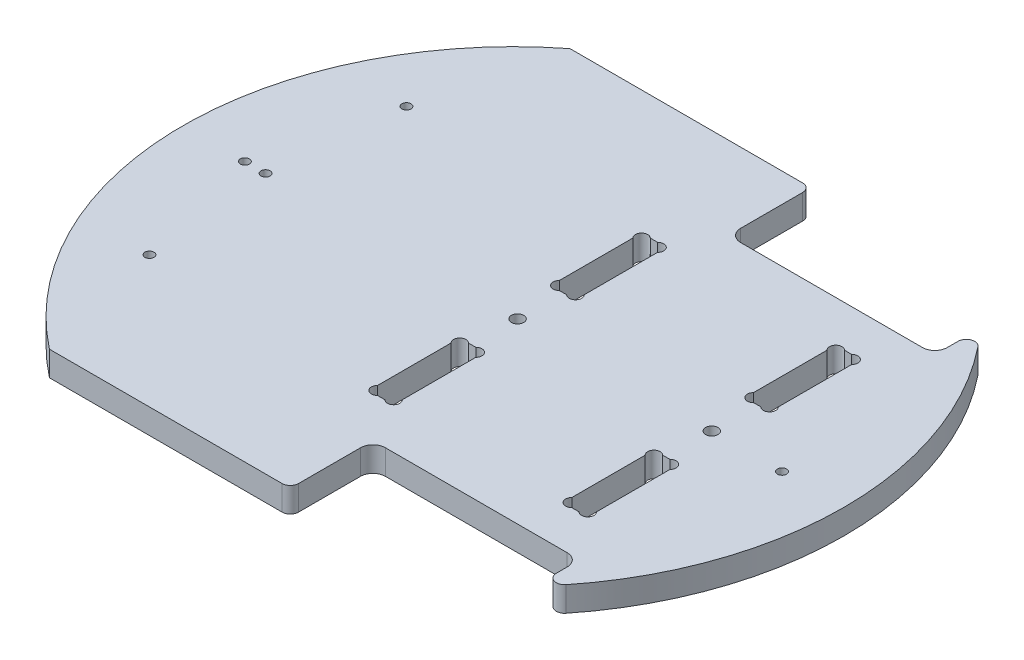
ISO-10303-21;
HEADER;
FILE_DESCRIPTION(('STEP AP214'),'2;1');
FILE_NAME('part.step','',(''),(''),'','','');
FILE_SCHEMA(('AUTOMOTIVE_DESIGN { 1 0 10303 214 1 1 1 1 }'));
ENDSEC;
DATA;
#1=APPLICATION_CONTEXT('core data for automotive mechanical design processes');
#2=APPLICATION_PROTOCOL_DEFINITION('international standard','automotive_design',2000,#1);
#3=PRODUCT_CONTEXT('',#1,'mechanical');
#4=PRODUCT('Part','Part','',(#3));
#5=PRODUCT_RELATED_PRODUCT_CATEGORY('part','',(#4));
#6=PRODUCT_DEFINITION_FORMATION('','',#4);
#7=PRODUCT_DEFINITION_CONTEXT('part definition',#1,'design');
#8=PRODUCT_DEFINITION('design','',#6,#7);
#9=PRODUCT_DEFINITION_SHAPE('','',#8);
#10=(LENGTH_UNIT() NAMED_UNIT(*) SI_UNIT(.MILLI.,.METRE.));
#11=(NAMED_UNIT(*) PLANE_ANGLE_UNIT() SI_UNIT($,.RADIAN.));
#12=(NAMED_UNIT(*) SI_UNIT($,.STERADIAN.) SOLID_ANGLE_UNIT());
#13=UNCERTAINTY_MEASURE_WITH_UNIT(LENGTH_MEASURE(1.E-05),#10,'distance_accuracy_value','');
#14=(GEOMETRIC_REPRESENTATION_CONTEXT(3) GLOBAL_UNCERTAINTY_ASSIGNED_CONTEXT((#13)) GLOBAL_UNIT_ASSIGNED_CONTEXT((#10,
#11,#12)) REPRESENTATION_CONTEXT('',''));
#15=CARTESIAN_POINT('',(0.,0.,0.));
#16=DIRECTION('',(0.,0.,1.));
#17=DIRECTION('',(1.,0.,0.));
#18=AXIS2_PLACEMENT_3D('',#15,#16,#17);
#19=CARTESIAN_POINT('',(-15.0000471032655,6.,-4.02532128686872E-05));
#20=DIRECTION('',(0.,1.,0.));
#21=DIRECTION('',(0.,0.,1.));
#22=AXIS2_PLACEMENT_3D('',#19,#20,#21);
#23=PLANE('',#22);
#24=CARTESIAN_POINT('',(-72.,6.,-31.1));
#25=DIRECTION('',(0.,1.,0.));
#26=DIRECTION('',(0.,0.,-1.));
#27=AXIS2_PLACEMENT_3D('',#24,#25,#26);
#28=CIRCLE('',#27,1.10000000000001);
#29=CARTESIAN_POINT('',(-72.,6.,-32.2));
#30=VERTEX_POINT('',#29);
#31=EDGE_CURVE('E1372',#30,#30,#28,.T.);
#32=ORIENTED_EDGE('',*,*,#31,.F.);
#33=EDGE_LOOP('',(#32));
#34=FACE_BOUND('',#33,.T.);
#35=CARTESIAN_POINT('',(-14.0000000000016,6.,0.));
#36=DIRECTION('',(0.,1.,0.));
#37=DIRECTION('',(0.,0.,-1.));
#38=AXIS2_PLACEMENT_3D('',#35,#36,#37);
#39=CIRCLE('',#38,1.5);
#40=CARTESIAN_POINT('',(-14.0000000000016,6.,-1.5));
#41=VERTEX_POINT('',#40);
#42=EDGE_CURVE('E1384',#41,#41,#39,.T.);
#43=ORIENTED_EDGE('',*,*,#42,.F.);
#44=EDGE_LOOP('',(#43));
#45=FACE_BOUND('',#44,.T.);
#46=CARTESIAN_POINT('',(50.0000000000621,6.,0.));
#47=DIRECTION('',(0.,1.,0.));
#48=DIRECTION('',(0.,0.,1.));
#49=AXIS2_PLACEMENT_3D('',#46,#47,#48);
#50=CIRCLE('',#49,1.1);
#51=CARTESIAN_POINT('',(50.0000000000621,6.,1.1));
#52=VERTEX_POINT('',#51);
#53=EDGE_CURVE('E1396',#52,#52,#50,.T.);
#54=ORIENTED_EDGE('',*,*,#53,.F.);
#55=EDGE_LOOP('',(#54));
#56=FACE_BOUND('',#55,.T.);
#57=DIRECTION('',(0.,0.,-1.));
#58=VECTOR('',#57,1.);
#59=CARTESIAN_POINT('',(-11.0000000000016,6.,-13.1213203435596));
#60=LINE('',#59,#58);
#61=CARTESIAN_POINT('',(-11.0000000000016,6.,-13.1213203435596));
#62=VERTEX_POINT('',#61);
#63=CARTESIAN_POINT('',(-11.0000000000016,6.,-30.8786796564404));
#64=VERTEX_POINT('',#63);
#65=EDGE_CURVE('E396',#62,#64,#60,.T.);
#66=ORIENTED_EDGE('',*,*,#65,.F.);
#67=CARTESIAN_POINT('',(-12.0606601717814,6.,-12.0606601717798));
#68=DIRECTION('',(0.,1.,0.));
#69=DIRECTION('',(0.,0.,-1.));
#70=AXIS2_PLACEMENT_3D('',#67,#68,#69);
#71=CIRCLE('',#70,1.5);
#72=CARTESIAN_POINT('',(-13.1213203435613,6.,-11.));
#73=VERTEX_POINT('',#72);
#74=EDGE_CURVE('E367',#73,#62,#71,.T.);
#75=ORIENTED_EDGE('',*,*,#74,.F.);
#76=DIRECTION('',(1.,0.,0.));
#77=VECTOR('',#76,1.);
#78=CARTESIAN_POINT('',(-14.8786796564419,6.,-11.));
#79=LINE('',#78,#77);
#80=CARTESIAN_POINT('',(-14.8786796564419,6.,-11.));
#81=VERTEX_POINT('',#80);
#82=EDGE_CURVE('E408',#81,#73,#79,.T.);
#83=ORIENTED_EDGE('',*,*,#82,.F.);
#84=CARTESIAN_POINT('',(-15.9393398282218,6.,-12.0606601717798));
#85=DIRECTION('',(0.,1.,0.));
#86=DIRECTION('',(0.,0.,1.));
#87=AXIS2_PLACEMENT_3D('',#84,#85,#86);
#88=CIRCLE('',#87,1.5);
#89=CARTESIAN_POINT('',(-17.0000000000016,6.,-13.1213203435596));
#90=VERTEX_POINT('',#89);
#91=EDGE_CURVE('E406',#90,#81,#88,.T.);
#92=ORIENTED_EDGE('',*,*,#91,.F.);
#93=DIRECTION('',(0.,0.,1.));
#94=VECTOR('',#93,1.);
#95=CARTESIAN_POINT('',(-17.0000000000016,6.,-30.8786796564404));
#96=LINE('',#95,#94);
#97=CARTESIAN_POINT('',(-17.0000000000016,6.,-30.8786796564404));
#98=VERTEX_POINT('',#97);
#99=EDGE_CURVE('E404',#98,#90,#96,.T.);
#100=ORIENTED_EDGE('',*,*,#99,.F.);
#101=CARTESIAN_POINT('',(-15.9393398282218,6.,-31.9393398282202));
#102=DIRECTION('',(0.,1.,0.));
#103=DIRECTION('',(0.,0.,-1.));
#104=AXIS2_PLACEMENT_3D('',#101,#102,#103);
#105=CIRCLE('',#104,1.5);
#106=CARTESIAN_POINT('',(-14.878679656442,6.,-33.));
#107=VERTEX_POINT('',#106);
#108=EDGE_CURVE('E402',#107,#98,#105,.T.);
#109=ORIENTED_EDGE('',*,*,#108,.F.);
#110=DIRECTION('',(-1.,0.,0.));
#111=VECTOR('',#110,1.);
#112=CARTESIAN_POINT('',(-13.1213203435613,6.,-33.));
#113=LINE('',#112,#111);
#114=CARTESIAN_POINT('',(-13.1213203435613,6.,-33.));
#115=VERTEX_POINT('',#114);
#116=EDGE_CURVE('E400',#115,#107,#113,.T.);
#117=ORIENTED_EDGE('',*,*,#116,.F.);
#118=CARTESIAN_POINT('',(-12.0606601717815,6.,-31.9393398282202));
#119=DIRECTION('',(0.,1.,0.));
#120=DIRECTION('',(0.,0.,1.));
#121=AXIS2_PLACEMENT_3D('',#118,#119,#120);
#122=CIRCLE('',#121,1.50000000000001);
#123=EDGE_CURVE('E398',#64,#115,#122,.T.);
#124=ORIENTED_EDGE('',*,*,#123,.F.);
#125=EDGE_LOOP('',(#66,#75,#83,#92,#100,#109,#117,#124));
#126=FACE_BOUND('',#125,.T.);
#127=DIRECTION('',(0.,0.,1.));
#128=VECTOR('',#127,1.);
#129=CARTESIAN_POINT('',(29.9999999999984,6.,13.1213203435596));
#130=LINE('',#129,#128);
#131=CARTESIAN_POINT('',(29.9999999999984,6.,13.1213203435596));
#132=VERTEX_POINT('',#131);
#133=CARTESIAN_POINT('',(29.9999999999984,6.,30.8786796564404));
#134=VERTEX_POINT('',#133);
#135=EDGE_CURVE('E506',#132,#134,#130,.T.);
#136=ORIENTED_EDGE('',*,*,#135,.F.);
#137=CARTESIAN_POINT('',(31.0606601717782,6.,12.0606601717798));
#138=DIRECTION('',(0.,1.,0.));
#139=DIRECTION('',(0.,0.,-1.));
#140=AXIS2_PLACEMENT_3D('',#137,#138,#139);
#141=CIRCLE('',#140,1.5);
#142=CARTESIAN_POINT('',(32.121320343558,6.,11.));
#143=VERTEX_POINT('',#142);
#144=EDGE_CURVE('E504',#143,#132,#141,.T.);
#145=ORIENTED_EDGE('',*,*,#144,.F.);
#146=DIRECTION('',(-1.,0.,0.));
#147=VECTOR('',#146,1.);
#148=CARTESIAN_POINT('',(33.8786796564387,6.,11.));
#149=LINE('',#148,#147);
#150=CARTESIAN_POINT('',(33.8786796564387,6.,11.));
#151=VERTEX_POINT('',#150);
#152=EDGE_CURVE('E519',#151,#143,#149,.T.);
#153=ORIENTED_EDGE('',*,*,#152,.F.);
#154=CARTESIAN_POINT('',(34.9393398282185,6.,12.0606601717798));
#155=DIRECTION('',(0.,1.,0.));
#156=DIRECTION('',(0.,0.,1.));
#157=AXIS2_PLACEMENT_3D('',#154,#155,#156);
#158=CIRCLE('',#157,1.5);
#159=CARTESIAN_POINT('',(35.9999999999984,6.,13.1213203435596));
#160=VERTEX_POINT('',#159);
#161=EDGE_CURVE('E516',#160,#151,#158,.T.);
#162=ORIENTED_EDGE('',*,*,#161,.F.);
#163=DIRECTION('',(0.,0.,-1.));
#164=VECTOR('',#163,1.);
#165=CARTESIAN_POINT('',(35.9999999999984,6.,30.8786796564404));
#166=LINE('',#165,#164);
#167=CARTESIAN_POINT('',(35.9999999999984,6.,30.8786796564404));
#168=VERTEX_POINT('',#167);
#169=EDGE_CURVE('E514',#168,#160,#166,.T.);
#170=ORIENTED_EDGE('',*,*,#169,.F.);
#171=CARTESIAN_POINT('',(34.9393398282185,6.,31.9393398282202));
#172=DIRECTION('',(0.,1.,0.));
#173=DIRECTION('',(0.,0.,-1.));
#174=AXIS2_PLACEMENT_3D('',#171,#172,#173);
#175=CIRCLE('',#174,1.5);
#176=CARTESIAN_POINT('',(33.8786796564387,6.,33.));
#177=VERTEX_POINT('',#176);
#178=EDGE_CURVE('E512',#177,#168,#175,.T.);
#179=ORIENTED_EDGE('',*,*,#178,.F.);
#180=DIRECTION('',(1.,0.,0.));
#181=VECTOR('',#180,1.);
#182=CARTESIAN_POINT('',(32.121320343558,6.,33.));
#183=LINE('',#182,#181);
#184=CARTESIAN_POINT('',(32.121320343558,6.,33.));
#185=VERTEX_POINT('',#184);
#186=EDGE_CURVE('E510',#185,#177,#183,.T.);
#187=ORIENTED_EDGE('',*,*,#186,.F.);
#188=CARTESIAN_POINT('',(31.0606601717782,6.,31.9393398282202));
#189=DIRECTION('',(0.,1.,0.));
#190=DIRECTION('',(0.,0.,1.));
#191=AXIS2_PLACEMENT_3D('',#188,#189,#190);
#192=CIRCLE('',#191,1.5);
#193=EDGE_CURVE('E508',#134,#185,#192,.T.);
#194=ORIENTED_EDGE('',*,*,#193,.F.);
#195=EDGE_LOOP('',(#136,#145,#153,#162,#170,#179,#187,#194));
#196=FACE_BOUND('',#195,.T.);
#197=CARTESIAN_POINT('',(-15.0000471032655,6.,-4.02532128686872E-05));
#198=DIRECTION('',(0.,1.,0.));
#199=DIRECTION('',(0.,0.,1.));
#200=AXIS2_PLACEMENT_3D('',#197,#198,#199);
#201=CIRCLE('',#200,80.0000026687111);
#202=CARTESIAN_POINT('',(-64.3052112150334,6.,-63.0000499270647));
#203=VERTEX_POINT('',#202);
#204=CARTESIAN_POINT('',(-64.3051721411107,6.,63.0000000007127));
#205=VERTEX_POINT('',#204);
#206=EDGE_CURVE('E635',#203,#205,#201,.T.);
#207=ORIENTED_EDGE('',*,*,#206,.T.);
#208=DIRECTION('',(1.,0.,0.));
#209=VECTOR('',#208,1.);
#210=CARTESIAN_POINT('',(-64.3051721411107,6.,63.0000000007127));
#211=LINE('',#210,#209);
#212=CARTESIAN_POINT('',(-8.00000000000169,6.,63.0000000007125));
#213=VERTEX_POINT('',#212);
#214=EDGE_CURVE('E638',#205,#213,#211,.T.);
#215=ORIENTED_EDGE('',*,*,#214,.T.);
#216=CARTESIAN_POINT('',(-8.00000000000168,6.,61.0000000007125));
#217=DIRECTION('',(0.,1.,0.));
#218=DIRECTION('',(0.,0.,1.));
#219=AXIS2_PLACEMENT_3D('',#216,#217,#218);
#220=CIRCLE('',#219,2.);
#221=CARTESIAN_POINT('',(-6.00000000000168,6.,61.0000000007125));
#222=VERTEX_POINT('',#221);
#223=EDGE_CURVE('E640',#213,#222,#220,.T.);
#224=ORIENTED_EDGE('',*,*,#223,.T.);
#225=DIRECTION('',(0.,0.,-1.));
#226=VECTOR('',#225,1.);
#227=CARTESIAN_POINT('',(-6.00000000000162,6.,46.0000000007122));
#228=LINE('',#227,#226);
#229=CARTESIAN_POINT('',(-6.00000000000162,6.,46.0000000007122));
#230=VERTEX_POINT('',#229);
#231=EDGE_CURVE('E642',#222,#230,#228,.T.);
#232=ORIENTED_EDGE('',*,*,#231,.T.);
#233=CARTESIAN_POINT('',(-3.00000000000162,6.,46.0000000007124));
#234=DIRECTION('',(0.,-1.,0.));
#235=DIRECTION('',(0.,0.,1.));
#236=AXIS2_PLACEMENT_3D('',#233,#234,#235);
#237=CIRCLE('',#236,3.00000000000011);
#238=CARTESIAN_POINT('',(-3.0000000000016,6.,43.0000000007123));
#239=VERTEX_POINT('',#238);
#240=EDGE_CURVE('E644',#230,#239,#237,.T.);
#241=ORIENTED_EDGE('',*,*,#240,.T.);
#242=DIRECTION('',(1.,0.,0.));
#243=VECTOR('',#242,1.);
#244=CARTESIAN_POINT('',(-3.0000000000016,6.,43.0000000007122));
#245=LINE('',#244,#243);
#246=CARTESIAN_POINT('',(40.9999999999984,6.,43.0000000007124));
#247=VERTEX_POINT('',#246);
#248=EDGE_CURVE('E646',#239,#247,#245,.T.);
#249=ORIENTED_EDGE('',*,*,#248,.T.);
#250=CARTESIAN_POINT('',(40.9999999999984,6.,46.0000000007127));
#251=DIRECTION('',(0.,-1.,0.));
#252=DIRECTION('',(0.,0.,-1.));
#253=AXIS2_PLACEMENT_3D('',#250,#251,#252);
#254=CIRCLE('',#253,3.00000000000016);
#255=CARTESIAN_POINT('',(43.9999999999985,6.,46.0000000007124));
#256=VERTEX_POINT('',#255);
#257=EDGE_CURVE('E648',#247,#256,#254,.T.);
#258=ORIENTED_EDGE('',*,*,#257,.T.);
#259=DIRECTION('',(0.,0.,1.));
#260=VECTOR('',#259,1.);
#261=CARTESIAN_POINT('',(43.9999999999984,6.,46.0000000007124));
#262=LINE('',#261,#260);
#263=CARTESIAN_POINT('',(43.9999999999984,6.,48.6106984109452));
#264=VERTEX_POINT('',#263);
#265=EDGE_CURVE('E650',#256,#264,#262,.T.);
#266=ORIENTED_EDGE('',*,*,#265,.T.);
#267=CARTESIAN_POINT('',(45.9999999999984,6.,48.6106984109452));
#268=DIRECTION('',(0.,1.,0.));
#269=DIRECTION('',(0.,0.,1.));
#270=AXIS2_PLACEMENT_3D('',#267,#268,#269);
#271=CIRCLE('',#270,1.99999999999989);
#272=CARTESIAN_POINT('',(47.5641025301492,6.,49.8571266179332));
#273=VERTEX_POINT('',#272);
#274=EDGE_CURVE('E652',#264,#273,#271,.T.);
#275=ORIENTED_EDGE('',*,*,#274,.T.);
#276=CARTESIAN_POINT('',(-15.0000471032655,6.,-4.02532128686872E-05));
#277=DIRECTION('',(0.,1.,0.));
#278=DIRECTION('',(0.,0.,1.));
#279=AXIS2_PLACEMENT_3D('',#276,#277,#278);
#280=CIRCLE('',#279,80.000061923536);
#281=CARTESIAN_POINT('',(47.5641025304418,6.,-49.8572071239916));
#282=VERTEX_POINT('',#281);
#283=EDGE_CURVE('E654',#273,#282,#280,.T.);
#284=ORIENTED_EDGE('',*,*,#283,.T.);
#285=CARTESIAN_POINT('',(46.0000000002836,6.,-48.6107789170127));
#286=DIRECTION('',(0.,1.,0.));
#287=DIRECTION('',(0.,0.,-1.));
#288=AXIS2_PLACEMENT_3D('',#285,#286,#287);
#289=CIRCLE('',#288,1.99999999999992);
#290=CARTESIAN_POINT('',(44.0000000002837,6.,-48.6107789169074));
#291=VERTEX_POINT('',#290);
#292=EDGE_CURVE('E656',#282,#291,#289,.T.);
#293=ORIENTED_EDGE('',*,*,#292,.T.);
#294=DIRECTION('',(5.26853366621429E-11,0.,1.));
#295=VECTOR('',#294,1.);
#296=CARTESIAN_POINT('',(44.0000000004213,6.,-46.000001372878));
#297=LINE('',#296,#295);
#298=CARTESIAN_POINT('',(44.0000000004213,6.,-46.000001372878));
#299=VERTEX_POINT('',#298);
#300=EDGE_CURVE('E658',#291,#299,#297,.T.);
#301=ORIENTED_EDGE('',*,*,#300,.T.);
#302=CARTESIAN_POINT('',(41.0000000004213,6.,-46.0000013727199));
#303=DIRECTION('',(0.,-1.,0.));
#304=DIRECTION('',(0.,0.,1.));
#305=AXIS2_PLACEMENT_3D('',#302,#303,#304);
#306=CIRCLE('',#305,3.);
#307=CARTESIAN_POINT('',(40.9999998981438,6.,-43.0000013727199));
#308=VERTEX_POINT('',#307);
#309=EDGE_CURVE('E660',#299,#308,#306,.T.);
#310=ORIENTED_EDGE('',*,*,#309,.T.);
#311=DIRECTION('',(-0.999999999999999,0.,-3.40925181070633E-08));
#312=VECTOR('',#311,1.);
#313=CARTESIAN_POINT('',(-3.00000010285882,6.,-43.0000028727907));
#314=LINE('',#313,#312);
#315=CARTESIAN_POINT('',(-3.00000010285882,6.,-43.0000028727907));
#316=VERTEX_POINT('',#315);
#317=EDGE_CURVE('E662',#308,#316,#314,.T.);
#318=ORIENTED_EDGE('',*,*,#317,.T.);
#319=CARTESIAN_POINT('',(-3.00000000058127,6.,-46.0000028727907));
#320=DIRECTION('',(0.,-1.,0.));
#321=DIRECTION('',(0.,0.,-1.));
#322=AXIS2_PLACEMENT_3D('',#319,#320,#321);
#323=CIRCLE('',#322,3.);
#324=CARTESIAN_POINT('',(-6.00000000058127,6.,-46.0000028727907));
#325=VERTEX_POINT('',#324);
#326=EDGE_CURVE('E664',#316,#325,#323,.T.);
#327=ORIENTED_EDGE('',*,*,#326,.T.);
#328=DIRECTION('',(0.,0.,-1.));
#329=VECTOR('',#328,1.);
#330=CARTESIAN_POINT('',(-6.00000000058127,6.,-61.0000499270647));
#331=LINE('',#330,#329);
#332=CARTESIAN_POINT('',(-6.00000000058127,6.,-61.0000499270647));
#333=VERTEX_POINT('',#332);
#334=EDGE_CURVE('E666',#325,#333,#331,.T.);
#335=ORIENTED_EDGE('',*,*,#334,.T.);
#336=CARTESIAN_POINT('',(-8.00000000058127,6.,-61.0000499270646));
#337=DIRECTION('',(0.,1.,0.));
#338=DIRECTION('',(0.,0.,-1.));
#339=AXIS2_PLACEMENT_3D('',#336,#337,#338);
#340=CIRCLE('',#339,2.);
#341=CARTESIAN_POINT('',(-8.00000000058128,6.,-63.0000499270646));
#342=VERTEX_POINT('',#341);
#343=EDGE_CURVE('E668',#333,#342,#340,.T.);
#344=ORIENTED_EDGE('',*,*,#343,.T.);
#345=DIRECTION('',(-1.,0.,0.));
#346=VECTOR('',#345,1.);
#347=CARTESIAN_POINT('',(-64.3052112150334,6.,-63.0000499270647));
#348=LINE('',#347,#346);
#349=EDGE_CURVE('E670',#342,#203,#348,.T.);
#350=ORIENTED_EDGE('',*,*,#349,.T.);
#351=EDGE_LOOP('',(#207,#215,#224,#232,#241,#249,#258,#266,#275,#284,#293,#301,#310,#318,#327,
#335,#344,#350));
#352=FACE_BOUND('',#351,.T.);
#353=DIRECTION('',(-1.,0.,0.));
#354=VECTOR('',#353,1.);
#355=CARTESIAN_POINT('',(32.121320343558,6.,-33.));
#356=LINE('',#355,#354);
#357=CARTESIAN_POINT('',(33.8786796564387,6.,-33.));
#358=VERTEX_POINT('',#357);
#359=CARTESIAN_POINT('',(32.121320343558,6.,-33.));
#360=VERTEX_POINT('',#359);
#361=EDGE_CURVE('E565',#358,#360,#356,.T.);
#362=ORIENTED_EDGE('',*,*,#361,.F.);
#363=CARTESIAN_POINT('',(34.9393398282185,6.,-31.9393398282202));
#364=DIRECTION('',(0.,1.,0.));
#365=DIRECTION('',(0.,0.,1.));
#366=AXIS2_PLACEMENT_3D('',#363,#364,#365);
#367=CIRCLE('',#366,1.5);
#368=CARTESIAN_POINT('',(35.9999999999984,6.,-30.8786796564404));
#369=VERTEX_POINT('',#368);
#370=EDGE_CURVE('E563',#369,#358,#367,.T.);
#371=ORIENTED_EDGE('',*,*,#370,.F.);
#372=DIRECTION('',(0.,0.,-1.));
#373=VECTOR('',#372,1.);
#374=CARTESIAN_POINT('',(35.9999999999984,6.,-30.8786796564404));
#375=LINE('',#374,#373);
#376=CARTESIAN_POINT('',(35.9999999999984,6.,-13.1213203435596));
#377=VERTEX_POINT('',#376);
#378=EDGE_CURVE('E578',#377,#369,#375,.T.);
#379=ORIENTED_EDGE('',*,*,#378,.F.);
#380=CARTESIAN_POINT('',(34.9393398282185,6.,-12.0606601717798));
#381=DIRECTION('',(0.,1.,0.));
#382=DIRECTION('',(0.,0.,-1.));
#383=AXIS2_PLACEMENT_3D('',#380,#381,#382);
#384=CIRCLE('',#383,1.5);
#385=CARTESIAN_POINT('',(33.8786796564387,6.,-11.));
#386=VERTEX_POINT('',#385);
#387=EDGE_CURVE('E575',#386,#377,#384,.T.);
#388=ORIENTED_EDGE('',*,*,#387,.F.);
#389=DIRECTION('',(1.,0.,0.));
#390=VECTOR('',#389,1.);
#391=CARTESIAN_POINT('',(33.8786796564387,6.,-11.));
#392=LINE('',#391,#390);
#393=CARTESIAN_POINT('',(32.121320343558,6.,-11.));
#394=VERTEX_POINT('',#393);
#395=EDGE_CURVE('E573',#394,#386,#392,.T.);
#396=ORIENTED_EDGE('',*,*,#395,.F.);
#397=CARTESIAN_POINT('',(31.0606601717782,6.,-12.0606601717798));
#398=DIRECTION('',(0.,1.,0.));
#399=DIRECTION('',(0.,0.,1.));
#400=AXIS2_PLACEMENT_3D('',#397,#398,#399);
#401=CIRCLE('',#400,1.5);
#402=CARTESIAN_POINT('',(29.9999999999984,6.,-13.1213203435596));
#403=VERTEX_POINT('',#402);
#404=EDGE_CURVE('E571',#403,#394,#401,.T.);
#405=ORIENTED_EDGE('',*,*,#404,.F.);
#406=DIRECTION('',(0.,0.,1.));
#407=VECTOR('',#406,1.);
#408=CARTESIAN_POINT('',(29.9999999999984,6.,-13.1213203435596));
#409=LINE('',#408,#407);
#410=CARTESIAN_POINT('',(29.9999999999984,6.,-30.8786796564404));
#411=VERTEX_POINT('',#410);
#412=EDGE_CURVE('E569',#411,#403,#409,.T.);
#413=ORIENTED_EDGE('',*,*,#412,.F.);
#414=CARTESIAN_POINT('',(31.0606601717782,6.,-31.9393398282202));
#415=DIRECTION('',(0.,1.,0.));
#416=DIRECTION('',(0.,0.,-1.));
#417=AXIS2_PLACEMENT_3D('',#414,#415,#416);
#418=CIRCLE('',#417,1.5);
#419=EDGE_CURVE('E567',#360,#411,#418,.T.);
#420=ORIENTED_EDGE('',*,*,#419,.F.);
#421=EDGE_LOOP('',(#362,#371,#379,#388,#396,#405,#413,#420));
#422=FACE_BOUND('',#421,.T.);
#423=DIRECTION('',(1.,0.,0.));
#424=VECTOR('',#423,1.);
#425=CARTESIAN_POINT('',(-13.1213203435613,6.,33.));
#426=LINE('',#425,#424);
#427=CARTESIAN_POINT('',(-14.8786796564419,6.,33.));
#428=VERTEX_POINT('',#427);
#429=CARTESIAN_POINT('',(-13.1213203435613,6.,33.));
#430=VERTEX_POINT('',#429);
#431=EDGE_CURVE('E447',#428,#430,#426,.T.);
#432=ORIENTED_EDGE('',*,*,#431,.F.);
#433=CARTESIAN_POINT('',(-15.9393398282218,6.,31.9393398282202));
#434=DIRECTION('',(0.,1.,0.));
#435=DIRECTION('',(0.,0.,1.));
#436=AXIS2_PLACEMENT_3D('',#433,#434,#435);
#437=CIRCLE('',#436,1.50000000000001);
#438=CARTESIAN_POINT('',(-17.0000000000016,6.,30.8786796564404));
#439=VERTEX_POINT('',#438);
#440=EDGE_CURVE('E445',#439,#428,#437,.T.);
#441=ORIENTED_EDGE('',*,*,#440,.F.);
#442=DIRECTION('',(0.,0.,1.));
#443=VECTOR('',#442,1.);
#444=CARTESIAN_POINT('',(-17.0000000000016,6.,30.8786796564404));
#445=LINE('',#444,#443);
#446=CARTESIAN_POINT('',(-17.0000000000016,6.,13.1213203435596));
#447=VERTEX_POINT('',#446);
#448=EDGE_CURVE('E460',#447,#439,#445,.T.);
#449=ORIENTED_EDGE('',*,*,#448,.F.);
#450=CARTESIAN_POINT('',(-15.9393398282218,6.,12.0606601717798));
#451=DIRECTION('',(0.,1.,0.));
#452=DIRECTION('',(0.,0.,-1.));
#453=AXIS2_PLACEMENT_3D('',#450,#451,#452);
#454=CIRCLE('',#453,1.5);
#455=CARTESIAN_POINT('',(-14.8786796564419,6.,11.));
#456=VERTEX_POINT('',#455);
#457=EDGE_CURVE('E457',#456,#447,#454,.T.);
#458=ORIENTED_EDGE('',*,*,#457,.F.);
#459=DIRECTION('',(-1.,0.,0.));
#460=VECTOR('',#459,1.);
#461=CARTESIAN_POINT('',(-14.8786796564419,6.,11.));
#462=LINE('',#461,#460);
#463=CARTESIAN_POINT('',(-13.1213203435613,6.,11.));
#464=VERTEX_POINT('',#463);
#465=EDGE_CURVE('E455',#464,#456,#462,.T.);
#466=ORIENTED_EDGE('',*,*,#465,.F.);
#467=CARTESIAN_POINT('',(-12.0606601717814,6.,12.0606601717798));
#468=DIRECTION('',(0.,1.,0.));
#469=DIRECTION('',(0.,0.,1.));
#470=AXIS2_PLACEMENT_3D('',#467,#468,#469);
#471=CIRCLE('',#470,1.5);
#472=CARTESIAN_POINT('',(-11.0000000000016,6.,13.1213203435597));
#473=VERTEX_POINT('',#472);
#474=EDGE_CURVE('E453',#473,#464,#471,.T.);
#475=ORIENTED_EDGE('',*,*,#474,.F.);
#476=DIRECTION('',(0.,0.,-1.));
#477=VECTOR('',#476,1.);
#478=CARTESIAN_POINT('',(-11.0000000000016,6.,13.1213203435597));
#479=LINE('',#478,#477);
#480=CARTESIAN_POINT('',(-11.0000000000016,6.,30.8786796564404));
#481=VERTEX_POINT('',#480);
#482=EDGE_CURVE('E451',#481,#473,#479,.T.);
#483=ORIENTED_EDGE('',*,*,#482,.F.);
#484=CARTESIAN_POINT('',(-12.0606601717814,6.,31.9393398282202));
#485=DIRECTION('',(0.,1.,0.));
#486=DIRECTION('',(0.,0.,-1.));
#487=AXIS2_PLACEMENT_3D('',#484,#485,#486);
#488=CIRCLE('',#487,1.50000000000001);
#489=EDGE_CURVE('E449',#430,#481,#488,.T.);
#490=ORIENTED_EDGE('',*,*,#489,.F.);
#491=EDGE_LOOP('',(#432,#441,#449,#458,#466,#475,#483,#490));
#492=FACE_BOUND('',#491,.T.);
#493=CARTESIAN_POINT('',(-80.,6.,0.));
#494=DIRECTION('',(0.,1.,0.));
#495=DIRECTION('',(0.,0.,1.));
#496=AXIS2_PLACEMENT_3D('',#493,#494,#495);
#497=CIRCLE('',#496,1.10000000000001);
#498=CARTESIAN_POINT('',(-80.,6.,1.10000000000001));
#499=VERTEX_POINT('',#498);
#500=EDGE_CURVE('E375',#499,#499,#497,.T.);
#501=ORIENTED_EDGE('',*,*,#500,.F.);
#502=EDGE_LOOP('',(#501));
#503=FACE_BOUND('',#502,.T.);
#504=CARTESIAN_POINT('',(32.9999999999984,6.,0.));
#505=DIRECTION('',(0.,1.,0.));
#506=DIRECTION('',(0.,0.,1.));
#507=AXIS2_PLACEMENT_3D('',#504,#505,#506);
#508=CIRCLE('',#507,1.5);
#509=CARTESIAN_POINT('',(32.9999999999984,6.,1.5));
#510=VERTEX_POINT('',#509);
#511=EDGE_CURVE('E1390',#510,#510,#508,.T.);
#512=ORIENTED_EDGE('',*,*,#511,.F.);
#513=EDGE_LOOP('',(#512));
#514=FACE_BOUND('',#513,.T.);
#515=CARTESIAN_POINT('',(-72.,6.,31.1));
#516=DIRECTION('',(0.,1.,0.));
#517=DIRECTION('',(0.,0.,1.));
#518=AXIS2_PLACEMENT_3D('',#515,#516,#517);
#519=CIRCLE('',#518,1.10000000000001);
#520=CARTESIAN_POINT('',(-72.,6.,32.2));
#521=VERTEX_POINT('',#520);
#522=EDGE_CURVE('E1378',#521,#521,#519,.T.);
#523=ORIENTED_EDGE('',*,*,#522,.F.);
#524=EDGE_LOOP('',(#523));
#525=FACE_BOUND('',#524,.T.);
#526=CARTESIAN_POINT('',(-75.,6.,0.));
#527=DIRECTION('',(0.,1.,0.));
#528=DIRECTION('',(0.,0.,1.));
#529=AXIS2_PLACEMENT_3D('',#526,#527,#528);
#530=CIRCLE('',#529,1.10000000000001);
#531=CARTESIAN_POINT('',(-75.,6.,1.10000000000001));
#532=VERTEX_POINT('',#531);
#533=EDGE_CURVE('E1361',#532,#532,#530,.T.);
#534=ORIENTED_EDGE('',*,*,#533,.F.);
#535=EDGE_LOOP('',(#534));
#536=FACE_BOUND('',#535,.T.);
#537=ADVANCED_FACE('F35',(#34,#45,#56,#126,#196,#352,#422,#492,#503,#514,#525,#536),#23,.T.);
#538=CARTESIAN_POINT('',(-15.0000471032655,0.,-4.02532128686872E-05));
#539=DIRECTION('',(0.,1.,0.));
#540=DIRECTION('',(0.,0.,1.));
#541=AXIS2_PLACEMENT_3D('',#538,#539,#540);
#542=PLANE('',#541);
#543=CARTESIAN_POINT('',(-72.,0.,-31.1));
#544=DIRECTION('',(0.,1.,0.));
#545=DIRECTION('',(0.,0.,-1.));
#546=AXIS2_PLACEMENT_3D('',#543,#544,#545);
#547=CIRCLE('',#546,1.10000000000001);
#548=CARTESIAN_POINT('',(-72.,0.,-32.2));
#549=VERTEX_POINT('',#548);
#550=EDGE_CURVE('E1367',#549,#549,#547,.T.);
#551=ORIENTED_EDGE('',*,*,#550,.T.);
#552=EDGE_LOOP('',(#551));
#553=FACE_BOUND('',#552,.T.);
#554=CARTESIAN_POINT('',(-14.0000000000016,0.,0.));
#555=DIRECTION('',(0.,1.,0.));
#556=DIRECTION('',(0.,0.,-1.));
#557=AXIS2_PLACEMENT_3D('',#554,#555,#556);
#558=CIRCLE('',#557,1.5);
#559=CARTESIAN_POINT('',(-14.0000000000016,0.,-1.5));
#560=VERTEX_POINT('',#559);
#561=EDGE_CURVE('E1381',#560,#560,#558,.T.);
#562=ORIENTED_EDGE('',*,*,#561,.T.);
#563=EDGE_LOOP('',(#562));
#564=FACE_BOUND('',#563,.T.);
#565=CARTESIAN_POINT('',(50.0000000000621,0.,0.));
#566=DIRECTION('',(0.,1.,0.));
#567=DIRECTION('',(0.,0.,1.));
#568=AXIS2_PLACEMENT_3D('',#565,#566,#567);
#569=CIRCLE('',#568,1.1);
#570=CARTESIAN_POINT('',(50.0000000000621,0.,1.1));
#571=VERTEX_POINT('',#570);
#572=EDGE_CURVE('E1393',#571,#571,#569,.T.);
#573=ORIENTED_EDGE('',*,*,#572,.T.);
#574=EDGE_LOOP('',(#573));
#575=FACE_BOUND('',#574,.T.);
#576=CARTESIAN_POINT('',(-12.0606601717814,0.,-12.0606601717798));
#577=DIRECTION('',(0.,1.,0.));
#578=DIRECTION('',(0.,0.,-1.));
#579=AXIS2_PLACEMENT_3D('',#576,#577,#578);
#580=CIRCLE('',#579,1.5);
#581=CARTESIAN_POINT('',(-13.1213203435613,0.,-11.));
#582=VERTEX_POINT('',#581);
#583=CARTESIAN_POINT('',(-11.0000000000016,0.,-13.1213203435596));
#584=VERTEX_POINT('',#583);
#585=EDGE_CURVE('E58',#582,#584,#580,.T.);
#586=ORIENTED_EDGE('',*,*,#585,.T.);
#587=DIRECTION('',(0.,0.,-1.));
#588=VECTOR('',#587,1.);
#589=CARTESIAN_POINT('',(-11.0000000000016,0.,-13.1213203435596));
#590=LINE('',#589,#588);
#591=CARTESIAN_POINT('',(-11.0000000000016,0.,-30.8786796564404));
#592=VERTEX_POINT('',#591);
#593=EDGE_CURVE('E354',#584,#592,#590,.T.);
#594=ORIENTED_EDGE('',*,*,#593,.T.);
#595=CARTESIAN_POINT('',(-12.0606601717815,0.,-31.9393398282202));
#596=DIRECTION('',(0.,1.,0.));
#597=DIRECTION('',(0.,0.,1.));
#598=AXIS2_PLACEMENT_3D('',#595,#596,#597);
#599=CIRCLE('',#598,1.50000000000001);
#600=CARTESIAN_POINT('',(-13.1213203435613,0.,-33.));
#601=VERTEX_POINT('',#600);
#602=EDGE_CURVE('E363',#592,#601,#599,.T.);
#603=ORIENTED_EDGE('',*,*,#602,.T.);
#604=DIRECTION('',(-1.,0.,0.));
#605=VECTOR('',#604,1.);
#606=CARTESIAN_POINT('',(-13.1213203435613,0.,-33.));
#607=LINE('',#606,#605);
#608=CARTESIAN_POINT('',(-14.878679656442,0.,-33.));
#609=VERTEX_POINT('',#608);
#610=EDGE_CURVE('E383',#601,#609,#607,.T.);
#611=ORIENTED_EDGE('',*,*,#610,.T.);
#612=CARTESIAN_POINT('',(-15.9393398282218,0.,-31.9393398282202));
#613=DIRECTION('',(0.,1.,0.));
#614=DIRECTION('',(0.,0.,-1.));
#615=AXIS2_PLACEMENT_3D('',#612,#613,#614);
#616=CIRCLE('',#615,1.5);
#617=CARTESIAN_POINT('',(-17.0000000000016,0.,-30.8786796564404));
#618=VERTEX_POINT('',#617);
#619=EDGE_CURVE('E386',#609,#618,#616,.T.);
#620=ORIENTED_EDGE('',*,*,#619,.T.);
#621=DIRECTION('',(0.,0.,1.));
#622=VECTOR('',#621,1.);
#623=CARTESIAN_POINT('',(-17.0000000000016,0.,-30.8786796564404));
#624=LINE('',#623,#622);
#625=CARTESIAN_POINT('',(-17.0000000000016,0.,-13.1213203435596));
#626=VERTEX_POINT('',#625);
#627=EDGE_CURVE('E389',#618,#626,#624,.T.);
#628=ORIENTED_EDGE('',*,*,#627,.T.);
#629=CARTESIAN_POINT('',(-15.9393398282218,0.,-12.0606601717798));
#630=DIRECTION('',(0.,1.,0.));
#631=DIRECTION('',(0.,0.,1.));
#632=AXIS2_PLACEMENT_3D('',#629,#630,#631);
#633=CIRCLE('',#632,1.5);
#634=CARTESIAN_POINT('',(-14.8786796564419,0.,-11.));
#635=VERTEX_POINT('',#634);
#636=EDGE_CURVE('E392',#626,#635,#633,.T.);
#637=ORIENTED_EDGE('',*,*,#636,.T.);
#638=DIRECTION('',(1.,0.,0.));
#639=VECTOR('',#638,1.);
#640=CARTESIAN_POINT('',(-14.8786796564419,0.,-11.));
#641=LINE('',#640,#639);
#642=EDGE_CURVE('E374',#635,#582,#641,.T.);
#643=ORIENTED_EDGE('',*,*,#642,.T.);
#644=EDGE_LOOP('',(#586,#594,#603,#611,#620,#628,#637,#643));
#645=FACE_BOUND('',#644,.T.);
#646=CARTESIAN_POINT('',(31.0606601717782,0.,12.0606601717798));
#647=DIRECTION('',(0.,1.,0.));
#648=DIRECTION('',(0.,0.,-1.));
#649=AXIS2_PLACEMENT_3D('',#646,#647,#648);
#650=CIRCLE('',#649,1.5);
#651=CARTESIAN_POINT('',(32.121320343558,0.,11.));
#652=VERTEX_POINT('',#651);
#653=CARTESIAN_POINT('',(29.9999999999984,0.,13.1213203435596));
#654=VERTEX_POINT('',#653);
#655=EDGE_CURVE('E480',#652,#654,#650,.T.);
#656=ORIENTED_EDGE('',*,*,#655,.T.);
#657=DIRECTION('',(0.,0.,1.));
#658=VECTOR('',#657,1.);
#659=CARTESIAN_POINT('',(29.9999999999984,0.,13.1213203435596));
#660=LINE('',#659,#658);
#661=CARTESIAN_POINT('',(29.9999999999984,0.,30.8786796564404));
#662=VERTEX_POINT('',#661);
#663=EDGE_CURVE('E483',#654,#662,#660,.T.);
#664=ORIENTED_EDGE('',*,*,#663,.T.);
#665=CARTESIAN_POINT('',(31.0606601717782,0.,31.9393398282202));
#666=DIRECTION('',(0.,1.,0.));
#667=DIRECTION('',(0.,0.,1.));
#668=AXIS2_PLACEMENT_3D('',#665,#666,#667);
#669=CIRCLE('',#668,1.5);
#670=CARTESIAN_POINT('',(32.121320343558,0.,33.));
#671=VERTEX_POINT('',#670);
#672=EDGE_CURVE('E486',#662,#671,#669,.T.);
#673=ORIENTED_EDGE('',*,*,#672,.T.);
#674=DIRECTION('',(1.,0.,0.));
#675=VECTOR('',#674,1.);
#676=CARTESIAN_POINT('',(32.121320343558,0.,33.));
#677=LINE('',#676,#675);
#678=CARTESIAN_POINT('',(33.8786796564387,0.,33.));
#679=VERTEX_POINT('',#678);
#680=EDGE_CURVE('E489',#671,#679,#677,.T.);
#681=ORIENTED_EDGE('',*,*,#680,.T.);
#682=CARTESIAN_POINT('',(34.9393398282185,0.,31.9393398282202));
#683=DIRECTION('',(0.,1.,0.));
#684=DIRECTION('',(0.,0.,-1.));
#685=AXIS2_PLACEMENT_3D('',#682,#683,#684);
#686=CIRCLE('',#685,1.5);
#687=CARTESIAN_POINT('',(35.9999999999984,0.,30.8786796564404));
#688=VERTEX_POINT('',#687);
#689=EDGE_CURVE('E492',#679,#688,#686,.T.);
#690=ORIENTED_EDGE('',*,*,#689,.T.);
#691=DIRECTION('',(0.,0.,-1.));
#692=VECTOR('',#691,1.);
#693=CARTESIAN_POINT('',(35.9999999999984,0.,30.8786796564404));
#694=LINE('',#693,#692);
#695=CARTESIAN_POINT('',(35.9999999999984,0.,13.1213203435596));
#696=VERTEX_POINT('',#695);
#697=EDGE_CURVE('E495',#688,#696,#694,.T.);
#698=ORIENTED_EDGE('',*,*,#697,.T.);
#699=CARTESIAN_POINT('',(34.9393398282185,0.,12.0606601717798));
#700=DIRECTION('',(0.,1.,0.));
#701=DIRECTION('',(0.,0.,1.));
#702=AXIS2_PLACEMENT_3D('',#699,#700,#701);
#703=CIRCLE('',#702,1.5);
#704=CARTESIAN_POINT('',(33.8786796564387,0.,11.));
#705=VERTEX_POINT('',#704);
#706=EDGE_CURVE('E498',#696,#705,#703,.T.);
#707=ORIENTED_EDGE('',*,*,#706,.T.);
#708=DIRECTION('',(-1.,0.,0.));
#709=VECTOR('',#708,1.);
#710=CARTESIAN_POINT('',(33.8786796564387,0.,11.));
#711=LINE('',#710,#709);
#712=EDGE_CURVE('E501',#705,#652,#711,.T.);
#713=ORIENTED_EDGE('',*,*,#712,.T.);
#714=EDGE_LOOP('',(#656,#664,#673,#681,#690,#698,#707,#713));
#715=FACE_BOUND('',#714,.T.);
#716=CARTESIAN_POINT('',(-15.0000471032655,0.,-4.02532128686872E-05));
#717=DIRECTION('',(0.,1.,0.));
#718=DIRECTION('',(0.,0.,1.));
#719=AXIS2_PLACEMENT_3D('',#716,#717,#718);
#720=CIRCLE('',#719,80.0000026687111);
#721=CARTESIAN_POINT('',(-64.3052112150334,0.,-63.0000499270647));
#722=VERTEX_POINT('',#721);
#723=CARTESIAN_POINT('',(-64.3051721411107,0.,63.0000000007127));
#724=VERTEX_POINT('',#723);
#725=EDGE_CURVE('E598',#722,#724,#720,.T.);
#726=ORIENTED_EDGE('',*,*,#725,.F.);
#727=DIRECTION('',(-1.,0.,0.));
#728=VECTOR('',#727,1.);
#729=CARTESIAN_POINT('',(-64.3052112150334,0.,-63.0000499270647));
#730=LINE('',#729,#728);
#731=CARTESIAN_POINT('',(-8.00000000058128,0.,-63.0000499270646));
#732=VERTEX_POINT('',#731);
#733=EDGE_CURVE('E633',#732,#722,#730,.T.);
#734=ORIENTED_EDGE('',*,*,#733,.F.);
#735=CARTESIAN_POINT('',(-8.00000000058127,0.,-61.0000499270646));
#736=DIRECTION('',(0.,1.,0.));
#737=DIRECTION('',(0.,0.,-1.));
#738=AXIS2_PLACEMENT_3D('',#735,#736,#737);
#739=CIRCLE('',#738,2.);
#740=CARTESIAN_POINT('',(-6.00000000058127,0.,-61.0000499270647));
#741=VERTEX_POINT('',#740);
#742=EDGE_CURVE('E631',#741,#732,#739,.T.);
#743=ORIENTED_EDGE('',*,*,#742,.F.);
#744=DIRECTION('',(0.,0.,-1.));
#745=VECTOR('',#744,1.);
#746=CARTESIAN_POINT('',(-6.00000000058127,0.,-61.0000499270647));
#747=LINE('',#746,#745);
#748=CARTESIAN_POINT('',(-6.00000000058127,0.,-46.0000028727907));
#749=VERTEX_POINT('',#748);
#750=EDGE_CURVE('E629',#749,#741,#747,.T.);
#751=ORIENTED_EDGE('',*,*,#750,.F.);
#752=CARTESIAN_POINT('',(-3.00000000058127,0.,-46.0000028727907));
#753=DIRECTION('',(0.,-1.,0.));
#754=DIRECTION('',(0.,0.,-1.));
#755=AXIS2_PLACEMENT_3D('',#752,#753,#754);
#756=CIRCLE('',#755,3.);
#757=CARTESIAN_POINT('',(-3.00000010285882,0.,-43.0000028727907));
#758=VERTEX_POINT('',#757);
#759=EDGE_CURVE('E627',#758,#749,#756,.T.);
#760=ORIENTED_EDGE('',*,*,#759,.F.);
#761=DIRECTION('',(-0.999999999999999,0.,-3.40925181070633E-08));
#762=VECTOR('',#761,1.);
#763=CARTESIAN_POINT('',(-3.00000010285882,0.,-43.0000028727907));
#764=LINE('',#763,#762);
#765=CARTESIAN_POINT('',(40.9999998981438,0.,-43.0000013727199));
#766=VERTEX_POINT('',#765);
#767=EDGE_CURVE('E625',#766,#758,#764,.T.);
#768=ORIENTED_EDGE('',*,*,#767,.F.);
#769=CARTESIAN_POINT('',(41.0000000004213,0.,-46.0000013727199));
#770=DIRECTION('',(0.,-1.,0.));
#771=DIRECTION('',(0.,0.,1.));
#772=AXIS2_PLACEMENT_3D('',#769,#770,#771);
#773=CIRCLE('',#772,3.);
#774=CARTESIAN_POINT('',(44.0000000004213,0.,-46.000001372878));
#775=VERTEX_POINT('',#774);
#776=EDGE_CURVE('E623',#775,#766,#773,.T.);
#777=ORIENTED_EDGE('',*,*,#776,.F.);
#778=DIRECTION('',(5.26853366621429E-11,0.,1.));
#779=VECTOR('',#778,1.);
#780=CARTESIAN_POINT('',(44.0000000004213,0.,-46.000001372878));
#781=LINE('',#780,#779);
#782=CARTESIAN_POINT('',(44.0000000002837,0.,-48.6107789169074));
#783=VERTEX_POINT('',#782);
#784=EDGE_CURVE('E621',#783,#775,#781,.T.);
#785=ORIENTED_EDGE('',*,*,#784,.F.);
#786=CARTESIAN_POINT('',(46.0000000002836,0.,-48.6107789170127));
#787=DIRECTION('',(0.,1.,0.));
#788=DIRECTION('',(0.,0.,-1.));
#789=AXIS2_PLACEMENT_3D('',#786,#787,#788);
#790=CIRCLE('',#789,1.99999999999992);
#791=CARTESIAN_POINT('',(47.5641025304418,0.,-49.8572071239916));
#792=VERTEX_POINT('',#791);
#793=EDGE_CURVE('E619',#792,#783,#790,.T.);
#794=ORIENTED_EDGE('',*,*,#793,.F.);
#795=CARTESIAN_POINT('',(-15.0000471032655,0.,-4.02532128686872E-05));
#796=DIRECTION('',(0.,1.,0.));
#797=DIRECTION('',(0.,0.,1.));
#798=AXIS2_PLACEMENT_3D('',#795,#796,#797);
#799=CIRCLE('',#798,80.000061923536);
#800=CARTESIAN_POINT('',(47.5641025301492,0.,49.8571266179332));
#801=VERTEX_POINT('',#800);
#802=EDGE_CURVE('E617',#801,#792,#799,.T.);
#803=ORIENTED_EDGE('',*,*,#802,.F.);
#804=CARTESIAN_POINT('',(45.9999999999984,0.,48.6106984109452));
#805=DIRECTION('',(0.,1.,0.));
#806=DIRECTION('',(0.,0.,1.));
#807=AXIS2_PLACEMENT_3D('',#804,#805,#806);
#808=CIRCLE('',#807,1.99999999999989);
#809=CARTESIAN_POINT('',(43.9999999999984,0.,48.6106984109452));
#810=VERTEX_POINT('',#809);
#811=EDGE_CURVE('E615',#810,#801,#808,.T.);
#812=ORIENTED_EDGE('',*,*,#811,.F.);
#813=DIRECTION('',(0.,0.,1.));
#814=VECTOR('',#813,1.);
#815=CARTESIAN_POINT('',(43.9999999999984,0.,46.0000000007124));
#816=LINE('',#815,#814);
#817=CARTESIAN_POINT('',(43.9999999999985,0.,46.0000000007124));
#818=VERTEX_POINT('',#817);
#819=EDGE_CURVE('E613',#818,#810,#816,.T.);
#820=ORIENTED_EDGE('',*,*,#819,.F.);
#821=CARTESIAN_POINT('',(40.9999999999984,0.,46.0000000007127));
#822=DIRECTION('',(0.,-1.,0.));
#823=DIRECTION('',(0.,0.,-1.));
#824=AXIS2_PLACEMENT_3D('',#821,#822,#823);
#825=CIRCLE('',#824,3.00000000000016);
#826=CARTESIAN_POINT('',(40.9999999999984,0.,43.0000000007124));
#827=VERTEX_POINT('',#826);
#828=EDGE_CURVE('E611',#827,#818,#825,.T.);
#829=ORIENTED_EDGE('',*,*,#828,.F.);
#830=DIRECTION('',(1.,0.,0.));
#831=VECTOR('',#830,1.);
#832=CARTESIAN_POINT('',(-3.0000000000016,0.,43.0000000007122));
#833=LINE('',#832,#831);
#834=CARTESIAN_POINT('',(-3.0000000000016,0.,43.0000000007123));
#835=VERTEX_POINT('',#834);
#836=EDGE_CURVE('E609',#835,#827,#833,.T.);
#837=ORIENTED_EDGE('',*,*,#836,.F.);
#838=CARTESIAN_POINT('',(-3.00000000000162,0.,46.0000000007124));
#839=DIRECTION('',(0.,-1.,0.));
#840=DIRECTION('',(0.,0.,1.));
#841=AXIS2_PLACEMENT_3D('',#838,#839,#840);
#842=CIRCLE('',#841,3.00000000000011);
#843=CARTESIAN_POINT('',(-6.00000000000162,0.,46.0000000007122));
#844=VERTEX_POINT('',#843);
#845=EDGE_CURVE('E607',#844,#835,#842,.T.);
#846=ORIENTED_EDGE('',*,*,#845,.F.);
#847=DIRECTION('',(0.,0.,-1.));
#848=VECTOR('',#847,1.);
#849=CARTESIAN_POINT('',(-6.00000000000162,0.,46.0000000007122));
#850=LINE('',#849,#848);
#851=CARTESIAN_POINT('',(-6.00000000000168,0.,61.0000000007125));
#852=VERTEX_POINT('',#851);
#853=EDGE_CURVE('E605',#852,#844,#850,.T.);
#854=ORIENTED_EDGE('',*,*,#853,.F.);
#855=CARTESIAN_POINT('',(-8.00000000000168,0.,61.0000000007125));
#856=DIRECTION('',(0.,1.,0.));
#857=DIRECTION('',(0.,0.,1.));
#858=AXIS2_PLACEMENT_3D('',#855,#856,#857);
#859=CIRCLE('',#858,2.);
#860=CARTESIAN_POINT('',(-8.00000000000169,0.,63.0000000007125));
#861=VERTEX_POINT('',#860);
#862=EDGE_CURVE('E603',#861,#852,#859,.T.);
#863=ORIENTED_EDGE('',*,*,#862,.F.);
#864=DIRECTION('',(1.,0.,0.));
#865=VECTOR('',#864,1.);
#866=CARTESIAN_POINT('',(-64.3051721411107,0.,63.0000000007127));
#867=LINE('',#866,#865);
#868=EDGE_CURVE('E601',#724,#861,#867,.T.);
#869=ORIENTED_EDGE('',*,*,#868,.F.);
#870=EDGE_LOOP('',(#726,#734,#743,#751,#760,#768,#777,#785,#794,#803,#812,#820,#829,#837,#846,
#854,#863,#869));
#871=FACE_BOUND('',#870,.T.);
#872=CARTESIAN_POINT('',(34.9393398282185,0.,-31.9393398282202));
#873=DIRECTION('',(0.,1.,0.));
#874=DIRECTION('',(0.,0.,1.));
#875=AXIS2_PLACEMENT_3D('',#872,#873,#874);
#876=CIRCLE('',#875,1.5);
#877=CARTESIAN_POINT('',(35.9999999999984,0.,-30.8786796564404));
#878=VERTEX_POINT('',#877);
#879=CARTESIAN_POINT('',(33.8786796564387,0.,-33.));
#880=VERTEX_POINT('',#879);
#881=EDGE_CURVE('E539',#878,#880,#876,.T.);
#882=ORIENTED_EDGE('',*,*,#881,.T.);
#883=DIRECTION('',(-1.,0.,0.));
#884=VECTOR('',#883,1.);
#885=CARTESIAN_POINT('',(32.121320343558,0.,-33.));
#886=LINE('',#885,#884);
#887=CARTESIAN_POINT('',(32.121320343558,0.,-33.));
#888=VERTEX_POINT('',#887);
#889=EDGE_CURVE('E542',#880,#888,#886,.T.);
#890=ORIENTED_EDGE('',*,*,#889,.T.);
#891=CARTESIAN_POINT('',(31.0606601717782,0.,-31.9393398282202));
#892=DIRECTION('',(0.,1.,0.));
#893=DIRECTION('',(0.,0.,-1.));
#894=AXIS2_PLACEMENT_3D('',#891,#892,#893);
#895=CIRCLE('',#894,1.5);
#896=CARTESIAN_POINT('',(29.9999999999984,0.,-30.8786796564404));
#897=VERTEX_POINT('',#896);
#898=EDGE_CURVE('E545',#888,#897,#895,.T.);
#899=ORIENTED_EDGE('',*,*,#898,.T.);
#900=DIRECTION('',(0.,0.,1.));
#901=VECTOR('',#900,1.);
#902=CARTESIAN_POINT('',(29.9999999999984,0.,-13.1213203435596));
#903=LINE('',#902,#901);
#904=CARTESIAN_POINT('',(29.9999999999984,0.,-13.1213203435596));
#905=VERTEX_POINT('',#904);
#906=EDGE_CURVE('E548',#897,#905,#903,.T.);
#907=ORIENTED_EDGE('',*,*,#906,.T.);
#908=CARTESIAN_POINT('',(31.0606601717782,0.,-12.0606601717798));
#909=DIRECTION('',(0.,1.,0.));
#910=DIRECTION('',(0.,0.,1.));
#911=AXIS2_PLACEMENT_3D('',#908,#909,#910);
#912=CIRCLE('',#911,1.5);
#913=CARTESIAN_POINT('',(32.121320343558,0.,-11.));
#914=VERTEX_POINT('',#913);
#915=EDGE_CURVE('E551',#905,#914,#912,.T.);
#916=ORIENTED_EDGE('',*,*,#915,.T.);
#917=DIRECTION('',(1.,0.,0.));
#918=VECTOR('',#917,1.);
#919=CARTESIAN_POINT('',(33.8786796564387,0.,-11.));
#920=LINE('',#919,#918);
#921=CARTESIAN_POINT('',(33.8786796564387,0.,-11.));
#922=VERTEX_POINT('',#921);
#923=EDGE_CURVE('E554',#914,#922,#920,.T.);
#924=ORIENTED_EDGE('',*,*,#923,.T.);
#925=CARTESIAN_POINT('',(34.9393398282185,0.,-12.0606601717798));
#926=DIRECTION('',(0.,1.,0.));
#927=DIRECTION('',(0.,0.,-1.));
#928=AXIS2_PLACEMENT_3D('',#925,#926,#927);
#929=CIRCLE('',#928,1.5);
#930=CARTESIAN_POINT('',(35.9999999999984,0.,-13.1213203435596));
#931=VERTEX_POINT('',#930);
#932=EDGE_CURVE('E557',#922,#931,#929,.T.);
#933=ORIENTED_EDGE('',*,*,#932,.T.);
#934=DIRECTION('',(0.,0.,-1.));
#935=VECTOR('',#934,1.);
#936=CARTESIAN_POINT('',(35.9999999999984,0.,-30.8786796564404));
#937=LINE('',#936,#935);
#938=EDGE_CURVE('E560',#931,#878,#937,.T.);
#939=ORIENTED_EDGE('',*,*,#938,.T.);
#940=EDGE_LOOP('',(#882,#890,#899,#907,#916,#924,#933,#939));
#941=FACE_BOUND('',#940,.T.);
#942=CARTESIAN_POINT('',(-15.9393398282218,0.,31.9393398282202));
#943=DIRECTION('',(0.,1.,0.));
#944=DIRECTION('',(0.,0.,1.));
#945=AXIS2_PLACEMENT_3D('',#942,#943,#944);
#946=CIRCLE('',#945,1.50000000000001);
#947=CARTESIAN_POINT('',(-17.0000000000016,0.,30.8786796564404));
#948=VERTEX_POINT('',#947);
#949=CARTESIAN_POINT('',(-14.8786796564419,0.,33.));
#950=VERTEX_POINT('',#949);
#951=EDGE_CURVE('E368',#948,#950,#946,.T.);
#952=ORIENTED_EDGE('',*,*,#951,.T.);
#953=DIRECTION('',(1.,0.,0.));
#954=VECTOR('',#953,1.);
#955=CARTESIAN_POINT('',(-13.1213203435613,0.,33.));
#956=LINE('',#955,#954);
#957=CARTESIAN_POINT('',(-13.1213203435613,0.,33.));
#958=VERTEX_POINT('',#957);
#959=EDGE_CURVE('E424',#950,#958,#956,.T.);
#960=ORIENTED_EDGE('',*,*,#959,.T.);
#961=CARTESIAN_POINT('',(-12.0606601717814,0.,31.9393398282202));
#962=DIRECTION('',(0.,1.,0.));
#963=DIRECTION('',(0.,0.,-1.));
#964=AXIS2_PLACEMENT_3D('',#961,#962,#963);
#965=CIRCLE('',#964,1.50000000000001);
#966=CARTESIAN_POINT('',(-11.0000000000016,0.,30.8786796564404));
#967=VERTEX_POINT('',#966);
#968=EDGE_CURVE('E427',#958,#967,#965,.T.);
#969=ORIENTED_EDGE('',*,*,#968,.T.);
#970=DIRECTION('',(0.,0.,-1.));
#971=VECTOR('',#970,1.);
#972=CARTESIAN_POINT('',(-11.0000000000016,0.,13.1213203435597));
#973=LINE('',#972,#971);
#974=CARTESIAN_POINT('',(-11.0000000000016,0.,13.1213203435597));
#975=VERTEX_POINT('',#974);
#976=EDGE_CURVE('E430',#967,#975,#973,.T.);
#977=ORIENTED_EDGE('',*,*,#976,.T.);
#978=CARTESIAN_POINT('',(-12.0606601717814,0.,12.0606601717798));
#979=DIRECTION('',(0.,1.,0.));
#980=DIRECTION('',(0.,0.,1.));
#981=AXIS2_PLACEMENT_3D('',#978,#979,#980);
#982=CIRCLE('',#981,1.5);
#983=CARTESIAN_POINT('',(-13.1213203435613,0.,11.));
#984=VERTEX_POINT('',#983);
#985=EDGE_CURVE('E433',#975,#984,#982,.T.);
#986=ORIENTED_EDGE('',*,*,#985,.T.);
#987=DIRECTION('',(-1.,0.,0.));
#988=VECTOR('',#987,1.);
#989=CARTESIAN_POINT('',(-14.8786796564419,0.,11.));
#990=LINE('',#989,#988);
#991=CARTESIAN_POINT('',(-14.8786796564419,0.,11.));
#992=VERTEX_POINT('',#991);
#993=EDGE_CURVE('E436',#984,#992,#990,.T.);
#994=ORIENTED_EDGE('',*,*,#993,.T.);
#995=CARTESIAN_POINT('',(-15.9393398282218,0.,12.0606601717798));
#996=DIRECTION('',(0.,1.,0.));
#997=DIRECTION('',(0.,0.,-1.));
#998=AXIS2_PLACEMENT_3D('',#995,#996,#997);
#999=CIRCLE('',#998,1.5);
#1000=CARTESIAN_POINT('',(-17.0000000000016,0.,13.1213203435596));
#1001=VERTEX_POINT('',#1000);
#1002=EDGE_CURVE('E439',#992,#1001,#999,.T.);
#1003=ORIENTED_EDGE('',*,*,#1002,.T.);
#1004=DIRECTION('',(0.,0.,1.));
#1005=VECTOR('',#1004,1.);
#1006=CARTESIAN_POINT('',(-17.0000000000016,0.,30.8786796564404));
#1007=LINE('',#1006,#1005);
#1008=EDGE_CURVE('E442',#1001,#948,#1007,.T.);
#1009=ORIENTED_EDGE('',*,*,#1008,.T.);
#1010=EDGE_LOOP('',(#952,#960,#969,#977,#986,#994,#1003,#1009));
#1011=FACE_BOUND('',#1010,.T.);
#1012=CARTESIAN_POINT('',(-80.,0.,0.));
#1013=DIRECTION('',(0.,1.,0.));
#1014=DIRECTION('',(0.,0.,1.));
#1015=AXIS2_PLACEMENT_3D('',#1012,#1013,#1014);
#1016=CIRCLE('',#1015,1.10000000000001);
#1017=CARTESIAN_POINT('',(-80.,0.,1.10000000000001));
#1018=VERTEX_POINT('',#1017);
#1019=EDGE_CURVE('E378',#1018,#1018,#1016,.T.);
#1020=ORIENTED_EDGE('',*,*,#1019,.T.);
#1021=EDGE_LOOP('',(#1020));
#1022=FACE_BOUND('',#1021,.T.);
#1023=CARTESIAN_POINT('',(32.9999999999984,0.,0.));
#1024=DIRECTION('',(0.,1.,0.));
#1025=DIRECTION('',(0.,0.,1.));
#1026=AXIS2_PLACEMENT_3D('',#1023,#1024,#1025);
#1027=CIRCLE('',#1026,1.5);
#1028=CARTESIAN_POINT('',(32.9999999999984,0.,1.5));
#1029=VERTEX_POINT('',#1028);
#1030=EDGE_CURVE('E1387',#1029,#1029,#1027,.T.);
#1031=ORIENTED_EDGE('',*,*,#1030,.T.);
#1032=EDGE_LOOP('',(#1031));
#1033=FACE_BOUND('',#1032,.T.);
#1034=CARTESIAN_POINT('',(-72.,0.,31.1));
#1035=DIRECTION('',(0.,1.,0.));
#1036=DIRECTION('',(0.,0.,1.));
#1037=AXIS2_PLACEMENT_3D('',#1034,#1035,#1036);
#1038=CIRCLE('',#1037,1.10000000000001);
#1039=CARTESIAN_POINT('',(-72.,0.,32.2));
#1040=VERTEX_POINT('',#1039);
#1041=EDGE_CURVE('E1375',#1040,#1040,#1038,.T.);
#1042=ORIENTED_EDGE('',*,*,#1041,.T.);
#1043=EDGE_LOOP('',(#1042));
#1044=FACE_BOUND('',#1043,.T.);
#1045=CARTESIAN_POINT('',(-75.,0.,0.));
#1046=DIRECTION('',(0.,1.,0.));
#1047=DIRECTION('',(0.,0.,1.));
#1048=AXIS2_PLACEMENT_3D('',#1045,#1046,#1047);
#1049=CIRCLE('',#1048,1.10000000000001);
#1050=CARTESIAN_POINT('',(-75.,0.,1.10000000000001));
#1051=VERTEX_POINT('',#1050);
#1052=EDGE_CURVE('E1364',#1051,#1051,#1049,.T.);
#1053=ORIENTED_EDGE('',*,*,#1052,.T.);
#1054=EDGE_LOOP('',(#1053));
#1055=FACE_BOUND('',#1054,.T.);
#1056=ADVANCED_FACE('F371',(#553,#564,#575,#645,#715,#871,#941,#1011,#1022,#1033,#1044,#1055),
#542,.F.);
#1057=CARTESIAN_POINT('',(-15.0000471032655,6.,-4.02532128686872E-05));
#1058=DIRECTION('',(0.,-1.,0.));
#1059=DIRECTION('',(0.,0.,-1.));
#1060=AXIS2_PLACEMENT_3D('',#1057,#1058,#1059);
#1061=CYLINDRICAL_SURFACE('',#1060,80.0000026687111);
#1062=ORIENTED_EDGE('',*,*,#725,.T.);
#1063=DIRECTION('',(0.,-1.,0.));
#1064=VECTOR('',#1063,1.);
#1065=CARTESIAN_POINT('',(-64.3051721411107,6.,63.0000000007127));
#1066=LINE('',#1065,#1064);
#1067=EDGE_CURVE('E11',#205,#724,#1066,.T.);
#1068=ORIENTED_EDGE('',*,*,#1067,.F.);
#1069=ORIENTED_EDGE('',*,*,#206,.F.);
#1070=DIRECTION('',(0.,-1.,0.));
#1071=VECTOR('',#1070,1.);
#1072=CARTESIAN_POINT('',(-64.3052112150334,6.,-63.0000499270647));
#1073=LINE('',#1072,#1071);
#1074=EDGE_CURVE('E672',#203,#722,#1073,.T.);
#1075=ORIENTED_EDGE('',*,*,#1074,.T.);
#1076=EDGE_LOOP('',(#1062,#1068,#1069,#1075));
#1077=FACE_BOUND('',#1076,.T.);
#1078=ADVANCED_FACE('F37',(#1077),#1061,.T.);
#1079=CARTESIAN_POINT('',(-64.3051721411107,6.,63.0000000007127));
#1080=DIRECTION('',(0.,0.,-1.));
#1081=DIRECTION('',(-1.,0.,0.));
#1082=AXIS2_PLACEMENT_3D('',#1079,#1080,#1081);
#1083=PLANE('',#1082);
#1084=ORIENTED_EDGE('',*,*,#868,.T.);
#1085=DIRECTION('',(0.,-1.,0.));
#1086=VECTOR('',#1085,1.);
#1087=CARTESIAN_POINT('',(-8.00000000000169,6.,63.0000000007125));
#1088=LINE('',#1087,#1086);
#1089=EDGE_CURVE('E43',#213,#861,#1088,.T.);
#1090=ORIENTED_EDGE('',*,*,#1089,.F.);
#1091=ORIENTED_EDGE('',*,*,#214,.F.);
#1092=ORIENTED_EDGE('',*,*,#1067,.T.);
#1093=EDGE_LOOP('',(#1084,#1090,#1091,#1092));
#1094=FACE_BOUND('',#1093,.T.);
#1095=ADVANCED_FACE('F747',(#1094),#1083,.F.);
#1096=CARTESIAN_POINT('',(-8.00000000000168,6.,61.0000000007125));
#1097=DIRECTION('',(0.,-1.,0.));
#1098=DIRECTION('',(0.,0.,-1.));
#1099=AXIS2_PLACEMENT_3D('',#1096,#1097,#1098);
#1100=CYLINDRICAL_SURFACE('',#1099,2.);
#1101=ORIENTED_EDGE('',*,*,#862,.T.);
#1102=DIRECTION('',(0.,-1.,0.));
#1103=VECTOR('',#1102,1.);
#1104=CARTESIAN_POINT('',(-6.00000000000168,6.,61.0000000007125));
#1105=LINE('',#1104,#1103);
#1106=EDGE_CURVE('E717',#222,#852,#1105,.T.);
#1107=ORIENTED_EDGE('',*,*,#1106,.F.);
#1108=ORIENTED_EDGE('',*,*,#223,.F.);
#1109=ORIENTED_EDGE('',*,*,#1089,.T.);
#1110=EDGE_LOOP('',(#1101,#1107,#1108,#1109));
#1111=FACE_BOUND('',#1110,.T.);
#1112=ADVANCED_FACE('F724',(#1111),#1100,.T.);
#1113=CARTESIAN_POINT('',(-6.00000000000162,6.,46.0000000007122));
#1114=DIRECTION('',(-1.,0.,0.));
#1115=DIRECTION('',(0.,0.,1.));
#1116=AXIS2_PLACEMENT_3D('',#1113,#1114,#1115);
#1117=PLANE('',#1116);
#1118=ORIENTED_EDGE('',*,*,#853,.T.);
#1119=DIRECTION('',(0.,-1.,0.));
#1120=VECTOR('',#1119,1.);
#1121=CARTESIAN_POINT('',(-6.00000000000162,6.,46.0000000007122));
#1122=LINE('',#1121,#1120);
#1123=EDGE_CURVE('E714',#230,#844,#1122,.T.);
#1124=ORIENTED_EDGE('',*,*,#1123,.F.);
#1125=ORIENTED_EDGE('',*,*,#231,.F.);
#1126=ORIENTED_EDGE('',*,*,#1106,.T.);
#1127=EDGE_LOOP('',(#1118,#1124,#1125,#1126));
#1128=FACE_BOUND('',#1127,.T.);
#1129=ADVANCED_FACE('F735',(#1128),#1117,.F.);
#1130=CARTESIAN_POINT('',(-3.00000000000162,6.,46.0000000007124));
#1131=DIRECTION('',(0.,-1.,0.));
#1132=DIRECTION('',(0.,0.,-1.));
#1133=AXIS2_PLACEMENT_3D('',#1130,#1131,#1132);
#1134=CYLINDRICAL_SURFACE('',#1133,3.00000000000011);
#1135=ORIENTED_EDGE('',*,*,#845,.T.);
#1136=DIRECTION('',(0.,-1.,0.));
#1137=VECTOR('',#1136,1.);
#1138=CARTESIAN_POINT('',(-3.0000000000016,6.,43.0000000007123));
#1139=LINE('',#1138,#1137);
#1140=EDGE_CURVE('E711',#239,#835,#1139,.T.);
#1141=ORIENTED_EDGE('',*,*,#1140,.F.);
#1142=ORIENTED_EDGE('',*,*,#240,.F.);
#1143=ORIENTED_EDGE('',*,*,#1123,.T.);
#1144=EDGE_LOOP('',(#1135,#1141,#1142,#1143));
#1145=FACE_BOUND('',#1144,.T.);
#1146=ADVANCED_FACE('F739',(#1145),#1134,.F.);
#1147=CARTESIAN_POINT('',(-3.0000000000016,6.,43.0000000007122));
#1148=DIRECTION('',(0.,0.,-1.));
#1149=DIRECTION('',(-1.,0.,0.));
#1150=AXIS2_PLACEMENT_3D('',#1147,#1148,#1149);
#1151=PLANE('',#1150);
#1152=ORIENTED_EDGE('',*,*,#836,.T.);
#1153=DIRECTION('',(0.,-1.,0.));
#1154=VECTOR('',#1153,1.);
#1155=CARTESIAN_POINT('',(40.9999999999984,6.,43.0000000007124));
#1156=LINE('',#1155,#1154);
#1157=EDGE_CURVE('E708',#247,#827,#1156,.T.);
#1158=ORIENTED_EDGE('',*,*,#1157,.F.);
#1159=ORIENTED_EDGE('',*,*,#248,.F.);
#1160=ORIENTED_EDGE('',*,*,#1140,.T.);
#1161=EDGE_LOOP('',(#1152,#1158,#1159,#1160));
#1162=FACE_BOUND('',#1161,.T.);
#1163=ADVANCED_FACE('F810',(#1162),#1151,.F.);
#1164=CARTESIAN_POINT('',(40.9999999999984,6.,46.0000000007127));
#1165=DIRECTION('',(0.,-1.,0.));
#1166=DIRECTION('',(0.,0.,-1.));
#1167=AXIS2_PLACEMENT_3D('',#1164,#1165,#1166);
#1168=CYLINDRICAL_SURFACE('',#1167,3.00000000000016);
#1169=ORIENTED_EDGE('',*,*,#828,.T.);
#1170=DIRECTION('',(0.,-1.,0.));
#1171=VECTOR('',#1170,1.);
#1172=CARTESIAN_POINT('',(43.9999999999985,6.,46.0000000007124));
#1173=LINE('',#1172,#1171);
#1174=EDGE_CURVE('E705',#256,#818,#1173,.T.);
#1175=ORIENTED_EDGE('',*,*,#1174,.F.);
#1176=ORIENTED_EDGE('',*,*,#257,.F.);
#1177=ORIENTED_EDGE('',*,*,#1157,.T.);
#1178=EDGE_LOOP('',(#1169,#1175,#1176,#1177));
#1179=FACE_BOUND('',#1178,.T.);
#1180=ADVANCED_FACE('F808',(#1179),#1168,.F.);
#1181=CARTESIAN_POINT('',(43.9999999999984,6.,46.0000000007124));
#1182=DIRECTION('',(1.,0.,0.));
#1183=DIRECTION('',(0.,0.,-1.));
#1184=AXIS2_PLACEMENT_3D('',#1181,#1182,#1183);
#1185=PLANE('',#1184);
#1186=ORIENTED_EDGE('',*,*,#819,.T.);
#1187=DIRECTION('',(0.,-1.,0.));
#1188=VECTOR('',#1187,1.);
#1189=CARTESIAN_POINT('',(43.9999999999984,6.,48.6106984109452));
#1190=LINE('',#1189,#1188);
#1191=EDGE_CURVE('E702',#264,#810,#1190,.T.);
#1192=ORIENTED_EDGE('',*,*,#1191,.F.);
#1193=ORIENTED_EDGE('',*,*,#265,.F.);
#1194=ORIENTED_EDGE('',*,*,#1174,.T.);
#1195=EDGE_LOOP('',(#1186,#1192,#1193,#1194));
#1196=FACE_BOUND('',#1195,.T.);
#1197=ADVANCED_FACE('F804',(#1196),#1185,.F.);
#1198=CARTESIAN_POINT('',(45.9999999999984,6.,48.6106984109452));
#1199=DIRECTION('',(0.,-1.,0.));
#1200=DIRECTION('',(0.,0.,-1.));
#1201=AXIS2_PLACEMENT_3D('',#1198,#1199,#1200);
#1202=CYLINDRICAL_SURFACE('',#1201,1.99999999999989);
#1203=ORIENTED_EDGE('',*,*,#811,.T.);
#1204=DIRECTION('',(0.,-1.,0.));
#1205=VECTOR('',#1204,1.);
#1206=CARTESIAN_POINT('',(47.5641025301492,6.,49.8571266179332));
#1207=LINE('',#1206,#1205);
#1208=EDGE_CURVE('E699',#273,#801,#1207,.T.);
#1209=ORIENTED_EDGE('',*,*,#1208,.F.);
#1210=ORIENTED_EDGE('',*,*,#274,.F.);
#1211=ORIENTED_EDGE('',*,*,#1191,.T.);
#1212=EDGE_LOOP('',(#1203,#1209,#1210,#1211));
#1213=FACE_BOUND('',#1212,.T.);
#1214=ADVANCED_FACE('F799',(#1213),#1202,.T.);
#1215=CARTESIAN_POINT('',(-15.0000471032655,6.,-4.02532128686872E-05));
#1216=DIRECTION('',(0.,-1.,0.));
#1217=DIRECTION('',(0.,0.,-1.));
#1218=AXIS2_PLACEMENT_3D('',#1215,#1216,#1217);
#1219=CYLINDRICAL_SURFACE('',#1218,80.000061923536);
#1220=ORIENTED_EDGE('',*,*,#802,.T.);
#1221=DIRECTION('',(0.,-1.,0.));
#1222=VECTOR('',#1221,1.);
#1223=CARTESIAN_POINT('',(47.5641025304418,6.,-49.8572071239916));
#1224=LINE('',#1223,#1222);
#1225=EDGE_CURVE('E696',#282,#792,#1224,.T.);
#1226=ORIENTED_EDGE('',*,*,#1225,.F.);
#1227=ORIENTED_EDGE('',*,*,#283,.F.);
#1228=ORIENTED_EDGE('',*,*,#1208,.T.);
#1229=EDGE_LOOP('',(#1220,#1226,#1227,#1228));
#1230=FACE_BOUND('',#1229,.T.);
#1231=ADVANCED_FACE('F793',(#1230),#1219,.T.);
#1232=CARTESIAN_POINT('',(46.0000000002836,6.,-48.6107789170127));
#1233=DIRECTION('',(0.,-1.,0.));
#1234=DIRECTION('',(0.,0.,-1.));
#1235=AXIS2_PLACEMENT_3D('',#1232,#1233,#1234);
#1236=CYLINDRICAL_SURFACE('',#1235,1.99999999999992);
#1237=ORIENTED_EDGE('',*,*,#793,.T.);
#1238=DIRECTION('',(0.,-1.,0.));
#1239=VECTOR('',#1238,1.);
#1240=CARTESIAN_POINT('',(44.0000000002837,6.,-48.6107789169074));
#1241=LINE('',#1240,#1239);
#1242=EDGE_CURVE('E693',#291,#783,#1241,.T.);
#1243=ORIENTED_EDGE('',*,*,#1242,.F.);
#1244=ORIENTED_EDGE('',*,*,#292,.F.);
#1245=ORIENTED_EDGE('',*,*,#1225,.T.);
#1246=EDGE_LOOP('',(#1237,#1243,#1244,#1245));
#1247=FACE_BOUND('',#1246,.T.);
#1248=ADVANCED_FACE('F789',(#1247),#1236,.T.);
#1249=CARTESIAN_POINT('',(44.0000000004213,6.,-46.000001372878));
#1250=DIRECTION('',(1.,0.,-5.26853366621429E-11));
#1251=DIRECTION('',(-5.26853366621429E-11,0.,-1.));
#1252=AXIS2_PLACEMENT_3D('',#1249,#1250,#1251);
#1253=PLANE('',#1252);
#1254=ORIENTED_EDGE('',*,*,#784,.T.);
#1255=DIRECTION('',(0.,-1.,0.));
#1256=VECTOR('',#1255,1.);
#1257=CARTESIAN_POINT('',(44.0000000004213,6.,-46.000001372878));
#1258=LINE('',#1257,#1256);
#1259=EDGE_CURVE('E690',#299,#775,#1258,.T.);
#1260=ORIENTED_EDGE('',*,*,#1259,.F.);
#1261=ORIENTED_EDGE('',*,*,#300,.F.);
#1262=ORIENTED_EDGE('',*,*,#1242,.T.);
#1263=EDGE_LOOP('',(#1254,#1260,#1261,#1262));
#1264=FACE_BOUND('',#1263,.T.);
#1265=ADVANCED_FACE('F784',(#1264),#1253,.F.);
#1266=CARTESIAN_POINT('',(41.0000000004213,6.,-46.0000013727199));
#1267=DIRECTION('',(0.,-1.,0.));
#1268=DIRECTION('',(0.,0.,-1.));
#1269=AXIS2_PLACEMENT_3D('',#1266,#1267,#1268);
#1270=CYLINDRICAL_SURFACE('',#1269,3.);
#1271=ORIENTED_EDGE('',*,*,#776,.T.);
#1272=DIRECTION('',(0.,-1.,0.));
#1273=VECTOR('',#1272,1.);
#1274=CARTESIAN_POINT('',(40.9999998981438,6.,-43.0000013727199));
#1275=LINE('',#1274,#1273);
#1276=EDGE_CURVE('E687',#308,#766,#1275,.T.);
#1277=ORIENTED_EDGE('',*,*,#1276,.F.);
#1278=ORIENTED_EDGE('',*,*,#309,.F.);
#1279=ORIENTED_EDGE('',*,*,#1259,.T.);
#1280=EDGE_LOOP('',(#1271,#1277,#1278,#1279));
#1281=FACE_BOUND('',#1280,.T.);
#1282=ADVANCED_FACE('F778',(#1281),#1270,.F.);
#1283=CARTESIAN_POINT('',(-3.00000010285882,6.,-43.0000028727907));
#1284=DIRECTION('',(-3.40925181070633E-08,0.,0.999999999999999));
#1285=DIRECTION('',(0.999999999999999,0.,3.40925181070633E-08));
#1286=AXIS2_PLACEMENT_3D('',#1283,#1284,#1285);
#1287=PLANE('',#1286);
#1288=ORIENTED_EDGE('',*,*,#767,.T.);
#1289=DIRECTION('',(0.,-1.,0.));
#1290=VECTOR('',#1289,1.);
#1291=CARTESIAN_POINT('',(-3.00000010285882,6.,-43.0000028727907));
#1292=LINE('',#1291,#1290);
#1293=EDGE_CURVE('E684',#316,#758,#1292,.T.);
#1294=ORIENTED_EDGE('',*,*,#1293,.F.);
#1295=ORIENTED_EDGE('',*,*,#317,.F.);
#1296=ORIENTED_EDGE('',*,*,#1276,.T.);
#1297=EDGE_LOOP('',(#1288,#1294,#1295,#1296));
#1298=FACE_BOUND('',#1297,.T.);
#1299=ADVANCED_FACE('F774',(#1298),#1287,.F.);
#1300=CARTESIAN_POINT('',(-3.00000000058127,6.,-46.0000028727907));
#1301=DIRECTION('',(0.,-1.,0.));
#1302=DIRECTION('',(0.,0.,-1.));
#1303=AXIS2_PLACEMENT_3D('',#1300,#1301,#1302);
#1304=CYLINDRICAL_SURFACE('',#1303,3.);
#1305=ORIENTED_EDGE('',*,*,#759,.T.);
#1306=DIRECTION('',(0.,-1.,0.));
#1307=VECTOR('',#1306,1.);
#1308=CARTESIAN_POINT('',(-6.00000000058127,6.,-46.0000028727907));
#1309=LINE('',#1308,#1307);
#1310=EDGE_CURVE('E681',#325,#749,#1309,.T.);
#1311=ORIENTED_EDGE('',*,*,#1310,.F.);
#1312=ORIENTED_EDGE('',*,*,#326,.F.);
#1313=ORIENTED_EDGE('',*,*,#1293,.T.);
#1314=EDGE_LOOP('',(#1305,#1311,#1312,#1313));
#1315=FACE_BOUND('',#1314,.T.);
#1316=ADVANCED_FACE('F769',(#1315),#1304,.F.);
#1317=CARTESIAN_POINT('',(-6.00000000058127,6.,-61.0000499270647));
#1318=DIRECTION('',(-1.,0.,0.));
#1319=DIRECTION('',(0.,0.,1.));
#1320=AXIS2_PLACEMENT_3D('',#1317,#1318,#1319);
#1321=PLANE('',#1320);
#1322=ORIENTED_EDGE('',*,*,#750,.T.);
#1323=DIRECTION('',(0.,-1.,0.));
#1324=VECTOR('',#1323,1.);
#1325=CARTESIAN_POINT('',(-6.00000000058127,6.,-61.0000499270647));
#1326=LINE('',#1325,#1324);
#1327=EDGE_CURVE('E678',#333,#741,#1326,.T.);
#1328=ORIENTED_EDGE('',*,*,#1327,.F.);
#1329=ORIENTED_EDGE('',*,*,#334,.F.);
#1330=ORIENTED_EDGE('',*,*,#1310,.T.);
#1331=EDGE_LOOP('',(#1322,#1328,#1329,#1330));
#1332=FACE_BOUND('',#1331,.T.);
#1333=ADVANCED_FACE('F763',(#1332),#1321,.F.);
#1334=CARTESIAN_POINT('',(-8.00000000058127,6.,-61.0000499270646));
#1335=DIRECTION('',(0.,-1.,0.));
#1336=DIRECTION('',(0.,0.,-1.));
#1337=AXIS2_PLACEMENT_3D('',#1334,#1335,#1336);
#1338=CYLINDRICAL_SURFACE('',#1337,2.);
#1339=ORIENTED_EDGE('',*,*,#742,.T.);
#1340=DIRECTION('',(0.,-1.,0.));
#1341=VECTOR('',#1340,1.);
#1342=CARTESIAN_POINT('',(-8.00000000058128,6.,-63.0000499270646));
#1343=LINE('',#1342,#1341);
#1344=EDGE_CURVE('E675',#342,#732,#1343,.T.);
#1345=ORIENTED_EDGE('',*,*,#1344,.F.);
#1346=ORIENTED_EDGE('',*,*,#343,.F.);
#1347=ORIENTED_EDGE('',*,*,#1327,.T.);
#1348=EDGE_LOOP('',(#1339,#1345,#1346,#1347));
#1349=FACE_BOUND('',#1348,.T.);
#1350=ADVANCED_FACE('F759',(#1349),#1338,.T.);
#1351=CARTESIAN_POINT('',(-64.3052112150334,6.,-63.0000499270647));
#1352=DIRECTION('',(0.,0.,1.));
#1353=DIRECTION('',(1.,0.,0.));
#1354=AXIS2_PLACEMENT_3D('',#1351,#1352,#1353);
#1355=PLANE('',#1354);
#1356=ORIENTED_EDGE('',*,*,#733,.T.);
#1357=ORIENTED_EDGE('',*,*,#1074,.F.);
#1358=ORIENTED_EDGE('',*,*,#349,.F.);
#1359=ORIENTED_EDGE('',*,*,#1344,.T.);
#1360=EDGE_LOOP('',(#1356,#1357,#1358,#1359));
#1361=FACE_BOUND('',#1360,.T.);
#1362=ADVANCED_FACE('F754',(#1361),#1355,.F.);
#1363=CARTESIAN_POINT('',(34.9393398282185,6.,-31.9393398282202));
#1364=DIRECTION('',(0.,-1.,0.));
#1365=DIRECTION('',(0.,0.,-1.));
#1366=AXIS2_PLACEMENT_3D('',#1363,#1364,#1365);
#1367=CYLINDRICAL_SURFACE('',#1366,1.5);
#1368=ORIENTED_EDGE('',*,*,#881,.F.);
#1369=DIRECTION('',(0.,-1.,0.));
#1370=VECTOR('',#1369,1.);
#1371=CARTESIAN_POINT('',(35.9999999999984,6.,-30.8786796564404));
#1372=LINE('',#1371,#1370);
#1373=EDGE_CURVE('E580',#369,#878,#1372,.T.);
#1374=ORIENTED_EDGE('',*,*,#1373,.F.);
#1375=ORIENTED_EDGE('',*,*,#370,.T.);
#1376=DIRECTION('',(0.,-1.,0.));
#1377=VECTOR('',#1376,1.);
#1378=CARTESIAN_POINT('',(33.8786796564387,6.,-33.));
#1379=LINE('',#1378,#1377);
#1380=EDGE_CURVE('E595',#358,#880,#1379,.T.);
#1381=ORIENTED_EDGE('',*,*,#1380,.T.);
#1382=EDGE_LOOP('',(#1368,#1374,#1375,#1381));
#1383=FACE_BOUND('',#1382,.T.);
#1384=ADVANCED_FACE('F833',(#1383),#1367,.F.);
#1385=CARTESIAN_POINT('',(32.121320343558,6.,-33.));
#1386=DIRECTION('',(0.,0.,1.));
#1387=DIRECTION('',(1.,0.,0.));
#1388=AXIS2_PLACEMENT_3D('',#1385,#1386,#1387);
#1389=PLANE('',#1388);
#1390=ORIENTED_EDGE('',*,*,#889,.F.);
#1391=ORIENTED_EDGE('',*,*,#1380,.F.);
#1392=ORIENTED_EDGE('',*,*,#361,.T.);
#1393=DIRECTION('',(0.,-1.,0.));
#1394=VECTOR('',#1393,1.);
#1395=CARTESIAN_POINT('',(32.121320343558,6.,-33.));
#1396=LINE('',#1395,#1394);
#1397=EDGE_CURVE('E593',#360,#888,#1396,.T.);
#1398=ORIENTED_EDGE('',*,*,#1397,.T.);
#1399=EDGE_LOOP('',(#1390,#1391,#1392,#1398));
#1400=FACE_BOUND('',#1399,.T.);
#1401=ADVANCED_FACE('F903',(#1400),#1389,.T.);
#1402=CARTESIAN_POINT('',(31.0606601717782,6.,-31.9393398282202));
#1403=DIRECTION('',(0.,-1.,0.));
#1404=DIRECTION('',(0.,0.,-1.));
#1405=AXIS2_PLACEMENT_3D('',#1402,#1403,#1404);
#1406=CYLINDRICAL_SURFACE('',#1405,1.5);
#1407=ORIENTED_EDGE('',*,*,#898,.F.);
#1408=ORIENTED_EDGE('',*,*,#1397,.F.);
#1409=ORIENTED_EDGE('',*,*,#419,.T.);
#1410=DIRECTION('',(0.,-1.,0.));
#1411=VECTOR('',#1410,1.);
#1412=CARTESIAN_POINT('',(29.9999999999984,6.,-30.8786796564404));
#1413=LINE('',#1412,#1411);
#1414=EDGE_CURVE('E591',#411,#897,#1413,.T.);
#1415=ORIENTED_EDGE('',*,*,#1414,.T.);
#1416=EDGE_LOOP('',(#1407,#1408,#1409,#1415));
#1417=FACE_BOUND('',#1416,.T.);
#1418=ADVANCED_FACE('F910',(#1417),#1406,.F.);
#1419=CARTESIAN_POINT('',(29.9999999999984,6.,-13.1213203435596));
#1420=DIRECTION('',(1.,0.,0.));
#1421=DIRECTION('',(0.,0.,-1.));
#1422=AXIS2_PLACEMENT_3D('',#1419,#1420,#1421);
#1423=PLANE('',#1422);
#1424=ORIENTED_EDGE('',*,*,#906,.F.);
#1425=ORIENTED_EDGE('',*,*,#1414,.F.);
#1426=ORIENTED_EDGE('',*,*,#412,.T.);
#1427=DIRECTION('',(0.,-1.,0.));
#1428=VECTOR('',#1427,1.);
#1429=CARTESIAN_POINT('',(29.9999999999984,6.,-13.1213203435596));
#1430=LINE('',#1429,#1428);
#1431=EDGE_CURVE('E589',#403,#905,#1430,.T.);
#1432=ORIENTED_EDGE('',*,*,#1431,.T.);
#1433=EDGE_LOOP('',(#1424,#1425,#1426,#1432));
#1434=FACE_BOUND('',#1433,.T.);
#1435=ADVANCED_FACE('F918',(#1434),#1423,.T.);
#1436=CARTESIAN_POINT('',(31.0606601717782,6.,-12.0606601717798));
#1437=DIRECTION('',(0.,-1.,0.));
#1438=DIRECTION('',(0.,0.,-1.));
#1439=AXIS2_PLACEMENT_3D('',#1436,#1437,#1438);
#1440=CYLINDRICAL_SURFACE('',#1439,1.5);
#1441=ORIENTED_EDGE('',*,*,#915,.F.);
#1442=ORIENTED_EDGE('',*,*,#1431,.F.);
#1443=ORIENTED_EDGE('',*,*,#404,.T.);
#1444=DIRECTION('',(0.,-1.,0.));
#1445=VECTOR('',#1444,1.);
#1446=CARTESIAN_POINT('',(32.121320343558,6.,-11.));
#1447=LINE('',#1446,#1445);
#1448=EDGE_CURVE('E587',#394,#914,#1447,.T.);
#1449=ORIENTED_EDGE('',*,*,#1448,.T.);
#1450=EDGE_LOOP('',(#1441,#1442,#1443,#1449));
#1451=FACE_BOUND('',#1450,.T.);
#1452=ADVANCED_FACE('F926',(#1451),#1440,.F.);
#1453=CARTESIAN_POINT('',(33.8786796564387,6.,-11.));
#1454=DIRECTION('',(0.,0.,-1.));
#1455=DIRECTION('',(-1.,0.,0.));
#1456=AXIS2_PLACEMENT_3D('',#1453,#1454,#1455);
#1457=PLANE('',#1456);
#1458=ORIENTED_EDGE('',*,*,#923,.F.);
#1459=ORIENTED_EDGE('',*,*,#1448,.F.);
#1460=ORIENTED_EDGE('',*,*,#395,.T.);
#1461=DIRECTION('',(0.,-1.,0.));
#1462=VECTOR('',#1461,1.);
#1463=CARTESIAN_POINT('',(33.8786796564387,6.,-11.));
#1464=LINE('',#1463,#1462);
#1465=EDGE_CURVE('E585',#386,#922,#1464,.T.);
#1466=ORIENTED_EDGE('',*,*,#1465,.T.);
#1467=EDGE_LOOP('',(#1458,#1459,#1460,#1466));
#1468=FACE_BOUND('',#1467,.T.);
#1469=ADVANCED_FACE('F934',(#1468),#1457,.T.);
#1470=CARTESIAN_POINT('',(34.9393398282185,6.,-12.0606601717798));
#1471=DIRECTION('',(0.,-1.,0.));
#1472=DIRECTION('',(0.,0.,-1.));
#1473=AXIS2_PLACEMENT_3D('',#1470,#1471,#1472);
#1474=CYLINDRICAL_SURFACE('',#1473,1.5);
#1475=ORIENTED_EDGE('',*,*,#932,.F.);
#1476=ORIENTED_EDGE('',*,*,#1465,.F.);
#1477=ORIENTED_EDGE('',*,*,#387,.T.);
#1478=DIRECTION('',(0.,-1.,0.));
#1479=VECTOR('',#1478,1.);
#1480=CARTESIAN_POINT('',(35.9999999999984,6.,-13.1213203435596));
#1481=LINE('',#1480,#1479);
#1482=EDGE_CURVE('E583',#377,#931,#1481,.T.);
#1483=ORIENTED_EDGE('',*,*,#1482,.T.);
#1484=EDGE_LOOP('',(#1475,#1476,#1477,#1483));
#1485=FACE_BOUND('',#1484,.T.);
#1486=ADVANCED_FACE('F942',(#1485),#1474,.F.);
#1487=CARTESIAN_POINT('',(35.9999999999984,6.,-30.8786796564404));
#1488=DIRECTION('',(-1.,0.,0.));
#1489=DIRECTION('',(0.,0.,1.));
#1490=AXIS2_PLACEMENT_3D('',#1487,#1488,#1489);
#1491=PLANE('',#1490);
#1492=ORIENTED_EDGE('',*,*,#938,.F.);
#1493=ORIENTED_EDGE('',*,*,#1482,.F.);
#1494=ORIENTED_EDGE('',*,*,#378,.T.);
#1495=ORIENTED_EDGE('',*,*,#1373,.T.);
#1496=EDGE_LOOP('',(#1492,#1493,#1494,#1495));
#1497=FACE_BOUND('',#1496,.T.);
#1498=ADVANCED_FACE('F950',(#1497),#1491,.T.);
#1499=CARTESIAN_POINT('',(31.0606601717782,6.,12.0606601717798));
#1500=DIRECTION('',(0.,-1.,0.));
#1501=DIRECTION('',(0.,0.,-1.));
#1502=AXIS2_PLACEMENT_3D('',#1499,#1500,#1501);
#1503=CYLINDRICAL_SURFACE('',#1502,1.5);
#1504=ORIENTED_EDGE('',*,*,#655,.F.);
#1505=DIRECTION('',(0.,-1.,0.));
#1506=VECTOR('',#1505,1.);
#1507=CARTESIAN_POINT('',(32.121320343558,6.,11.));
#1508=LINE('',#1507,#1506);
#1509=EDGE_CURVE('E521',#143,#652,#1508,.T.);
#1510=ORIENTED_EDGE('',*,*,#1509,.F.);
#1511=ORIENTED_EDGE('',*,*,#144,.T.);
#1512=DIRECTION('',(0.,-1.,0.));
#1513=VECTOR('',#1512,1.);
#1514=CARTESIAN_POINT('',(29.9999999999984,6.,13.1213203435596));
#1515=LINE('',#1514,#1513);
#1516=EDGE_CURVE('E536',#132,#654,#1515,.T.);
#1517=ORIENTED_EDGE('',*,*,#1516,.T.);
#1518=EDGE_LOOP('',(#1504,#1510,#1511,#1517));
#1519=FACE_BOUND('',#1518,.T.);
#1520=ADVANCED_FACE('F958',(#1519),#1503,.F.);
#1521=CARTESIAN_POINT('',(29.9999999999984,6.,13.1213203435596));
#1522=DIRECTION('',(1.,0.,0.));
#1523=DIRECTION('',(0.,0.,-1.));
#1524=AXIS2_PLACEMENT_3D('',#1521,#1522,#1523);
#1525=PLANE('',#1524);
#1526=ORIENTED_EDGE('',*,*,#663,.F.);
#1527=ORIENTED_EDGE('',*,*,#1516,.F.);
#1528=ORIENTED_EDGE('',*,*,#135,.T.);
#1529=DIRECTION('',(0.,-1.,0.));
#1530=VECTOR('',#1529,1.);
#1531=CARTESIAN_POINT('',(29.9999999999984,6.,30.8786796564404));
#1532=LINE('',#1531,#1530);
#1533=EDGE_CURVE('E534',#134,#662,#1532,.T.);
#1534=ORIENTED_EDGE('',*,*,#1533,.T.);
#1535=EDGE_LOOP('',(#1526,#1527,#1528,#1534));
#1536=FACE_BOUND('',#1535,.T.);
#1537=ADVANCED_FACE('F966',(#1536),#1525,.T.);
#1538=CARTESIAN_POINT('',(31.0606601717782,6.,31.9393398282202));
#1539=DIRECTION('',(0.,-1.,0.));
#1540=DIRECTION('',(0.,0.,-1.));
#1541=AXIS2_PLACEMENT_3D('',#1538,#1539,#1540);
#1542=CYLINDRICAL_SURFACE('',#1541,1.5);
#1543=ORIENTED_EDGE('',*,*,#672,.F.);
#1544=ORIENTED_EDGE('',*,*,#1533,.F.);
#1545=ORIENTED_EDGE('',*,*,#193,.T.);
#1546=DIRECTION('',(0.,-1.,0.));
#1547=VECTOR('',#1546,1.);
#1548=CARTESIAN_POINT('',(32.121320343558,6.,33.));
#1549=LINE('',#1548,#1547);
#1550=EDGE_CURVE('E532',#185,#671,#1549,.T.);
#1551=ORIENTED_EDGE('',*,*,#1550,.T.);
#1552=EDGE_LOOP('',(#1543,#1544,#1545,#1551));
#1553=FACE_BOUND('',#1552,.T.);
#1554=ADVANCED_FACE('F974',(#1553),#1542,.F.);
#1555=CARTESIAN_POINT('',(32.121320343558,6.,33.));
#1556=DIRECTION('',(0.,0.,-1.));
#1557=DIRECTION('',(-1.,0.,0.));
#1558=AXIS2_PLACEMENT_3D('',#1555,#1556,#1557);
#1559=PLANE('',#1558);
#1560=ORIENTED_EDGE('',*,*,#680,.F.);
#1561=ORIENTED_EDGE('',*,*,#1550,.F.);
#1562=ORIENTED_EDGE('',*,*,#186,.T.);
#1563=DIRECTION('',(0.,-1.,0.));
#1564=VECTOR('',#1563,1.);
#1565=CARTESIAN_POINT('',(33.8786796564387,6.,33.));
#1566=LINE('',#1565,#1564);
#1567=EDGE_CURVE('E530',#177,#679,#1566,.T.);
#1568=ORIENTED_EDGE('',*,*,#1567,.T.);
#1569=EDGE_LOOP('',(#1560,#1561,#1562,#1568));
#1570=FACE_BOUND('',#1569,.T.);
#1571=ADVANCED_FACE('F982',(#1570),#1559,.T.);
#1572=CARTESIAN_POINT('',(34.9393398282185,6.,31.9393398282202));
#1573=DIRECTION('',(0.,-1.,0.));
#1574=DIRECTION('',(0.,0.,-1.));
#1575=AXIS2_PLACEMENT_3D('',#1572,#1573,#1574);
#1576=CYLINDRICAL_SURFACE('',#1575,1.5);
#1577=ORIENTED_EDGE('',*,*,#689,.F.);
#1578=ORIENTED_EDGE('',*,*,#1567,.F.);
#1579=ORIENTED_EDGE('',*,*,#178,.T.);
#1580=DIRECTION('',(0.,-1.,0.));
#1581=VECTOR('',#1580,1.);
#1582=CARTESIAN_POINT('',(35.9999999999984,6.,30.8786796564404));
#1583=LINE('',#1582,#1581);
#1584=EDGE_CURVE('E528',#168,#688,#1583,.T.);
#1585=ORIENTED_EDGE('',*,*,#1584,.T.);
#1586=EDGE_LOOP('',(#1577,#1578,#1579,#1585));
#1587=FACE_BOUND('',#1586,.T.);
#1588=ADVANCED_FACE('F990',(#1587),#1576,.F.);
#1589=CARTESIAN_POINT('',(35.9999999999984,6.,30.8786796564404));
#1590=DIRECTION('',(-1.,0.,0.));
#1591=DIRECTION('',(0.,0.,1.));
#1592=AXIS2_PLACEMENT_3D('',#1589,#1590,#1591);
#1593=PLANE('',#1592);
#1594=ORIENTED_EDGE('',*,*,#697,.F.);
#1595=ORIENTED_EDGE('',*,*,#1584,.F.);
#1596=ORIENTED_EDGE('',*,*,#169,.T.);
#1597=DIRECTION('',(0.,-1.,0.));
#1598=VECTOR('',#1597,1.);
#1599=CARTESIAN_POINT('',(35.9999999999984,6.,13.1213203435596));
#1600=LINE('',#1599,#1598);
#1601=EDGE_CURVE('E526',#160,#696,#1600,.T.);
#1602=ORIENTED_EDGE('',*,*,#1601,.T.);
#1603=EDGE_LOOP('',(#1594,#1595,#1596,#1602));
#1604=FACE_BOUND('',#1603,.T.);
#1605=ADVANCED_FACE('F998',(#1604),#1593,.T.);
#1606=CARTESIAN_POINT('',(34.9393398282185,6.,12.0606601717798));
#1607=DIRECTION('',(0.,-1.,0.));
#1608=DIRECTION('',(0.,0.,-1.));
#1609=AXIS2_PLACEMENT_3D('',#1606,#1607,#1608);
#1610=CYLINDRICAL_SURFACE('',#1609,1.5);
#1611=ORIENTED_EDGE('',*,*,#706,.F.);
#1612=ORIENTED_EDGE('',*,*,#1601,.F.);
#1613=ORIENTED_EDGE('',*,*,#161,.T.);
#1614=DIRECTION('',(0.,-1.,0.));
#1615=VECTOR('',#1614,1.);
#1616=CARTESIAN_POINT('',(33.8786796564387,6.,11.));
#1617=LINE('',#1616,#1615);
#1618=EDGE_CURVE('E524',#151,#705,#1617,.T.);
#1619=ORIENTED_EDGE('',*,*,#1618,.T.);
#1620=EDGE_LOOP('',(#1611,#1612,#1613,#1619));
#1621=FACE_BOUND('',#1620,.T.);
#1622=ADVANCED_FACE('F1006',(#1621),#1610,.F.);
#1623=CARTESIAN_POINT('',(33.8786796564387,6.,11.));
#1624=DIRECTION('',(0.,0.,1.));
#1625=DIRECTION('',(1.,0.,0.));
#1626=AXIS2_PLACEMENT_3D('',#1623,#1624,#1625);
#1627=PLANE('',#1626);
#1628=ORIENTED_EDGE('',*,*,#712,.F.);
#1629=ORIENTED_EDGE('',*,*,#1618,.F.);
#1630=ORIENTED_EDGE('',*,*,#152,.T.);
#1631=ORIENTED_EDGE('',*,*,#1509,.T.);
#1632=EDGE_LOOP('',(#1628,#1629,#1630,#1631));
#1633=FACE_BOUND('',#1632,.T.);
#1634=ADVANCED_FACE('F1014',(#1633),#1627,.T.);
#1635=CARTESIAN_POINT('',(-15.9393398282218,6.,31.9393398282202));
#1636=DIRECTION('',(0.,-1.,0.));
#1637=DIRECTION('',(0.,0.,-1.));
#1638=AXIS2_PLACEMENT_3D('',#1635,#1636,#1637);
#1639=CYLINDRICAL_SURFACE('',#1638,1.50000000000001);
#1640=ORIENTED_EDGE('',*,*,#951,.F.);
#1641=DIRECTION('',(0.,-1.,0.));
#1642=VECTOR('',#1641,1.);
#1643=CARTESIAN_POINT('',(-17.0000000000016,6.,30.8786796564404));
#1644=LINE('',#1643,#1642);
#1645=EDGE_CURVE('E462',#439,#948,#1644,.T.);
#1646=ORIENTED_EDGE('',*,*,#1645,.F.);
#1647=ORIENTED_EDGE('',*,*,#440,.T.);
#1648=DIRECTION('',(0.,-1.,0.));
#1649=VECTOR('',#1648,1.);
#1650=CARTESIAN_POINT('',(-14.8786796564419,6.,33.));
#1651=LINE('',#1650,#1649);
#1652=EDGE_CURVE('E477',#428,#950,#1651,.T.);
#1653=ORIENTED_EDGE('',*,*,#1652,.T.);
#1654=EDGE_LOOP('',(#1640,#1646,#1647,#1653));
#1655=FACE_BOUND('',#1654,.T.);
#1656=ADVANCED_FACE('F1022',(#1655),#1639,.F.);
#1657=CARTESIAN_POINT('',(-13.1213203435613,6.,33.));
#1658=DIRECTION('',(0.,0.,-1.));
#1659=DIRECTION('',(-1.,0.,0.));
#1660=AXIS2_PLACEMENT_3D('',#1657,#1658,#1659);
#1661=PLANE('',#1660);
#1662=ORIENTED_EDGE('',*,*,#959,.F.);
#1663=ORIENTED_EDGE('',*,*,#1652,.F.);
#1664=ORIENTED_EDGE('',*,*,#431,.T.);
#1665=DIRECTION('',(0.,-1.,0.));
#1666=VECTOR('',#1665,1.);
#1667=CARTESIAN_POINT('',(-13.1213203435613,6.,33.));
#1668=LINE('',#1667,#1666);
#1669=EDGE_CURVE('E475',#430,#958,#1668,.T.);
#1670=ORIENTED_EDGE('',*,*,#1669,.T.);
#1671=EDGE_LOOP('',(#1662,#1663,#1664,#1670));
#1672=FACE_BOUND('',#1671,.T.);
#1673=ADVANCED_FACE('F1030',(#1672),#1661,.T.);
#1674=CARTESIAN_POINT('',(-12.0606601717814,6.,31.9393398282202));
#1675=DIRECTION('',(0.,-1.,0.));
#1676=DIRECTION('',(0.,0.,-1.));
#1677=AXIS2_PLACEMENT_3D('',#1674,#1675,#1676);
#1678=CYLINDRICAL_SURFACE('',#1677,1.50000000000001);
#1679=ORIENTED_EDGE('',*,*,#968,.F.);
#1680=ORIENTED_EDGE('',*,*,#1669,.F.);
#1681=ORIENTED_EDGE('',*,*,#489,.T.);
#1682=DIRECTION('',(0.,-1.,0.));
#1683=VECTOR('',#1682,1.);
#1684=CARTESIAN_POINT('',(-11.0000000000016,6.,30.8786796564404));
#1685=LINE('',#1684,#1683);
#1686=EDGE_CURVE('E473',#481,#967,#1685,.T.);
#1687=ORIENTED_EDGE('',*,*,#1686,.T.);
#1688=EDGE_LOOP('',(#1679,#1680,#1681,#1687));
#1689=FACE_BOUND('',#1688,.T.);
#1690=ADVANCED_FACE('F1038',(#1689),#1678,.F.);
#1691=CARTESIAN_POINT('',(-11.0000000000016,6.,13.1213203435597));
#1692=DIRECTION('',(-1.,0.,0.));
#1693=DIRECTION('',(0.,0.,1.));
#1694=AXIS2_PLACEMENT_3D('',#1691,#1692,#1693);
#1695=PLANE('',#1694);
#1696=ORIENTED_EDGE('',*,*,#976,.F.);
#1697=ORIENTED_EDGE('',*,*,#1686,.F.);
#1698=ORIENTED_EDGE('',*,*,#482,.T.);
#1699=DIRECTION('',(0.,-1.,0.));
#1700=VECTOR('',#1699,1.);
#1701=CARTESIAN_POINT('',(-11.0000000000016,6.,13.1213203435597));
#1702=LINE('',#1701,#1700);
#1703=EDGE_CURVE('E471',#473,#975,#1702,.T.);
#1704=ORIENTED_EDGE('',*,*,#1703,.T.);
#1705=EDGE_LOOP('',(#1696,#1697,#1698,#1704));
#1706=FACE_BOUND('',#1705,.T.);
#1707=ADVANCED_FACE('F1046',(#1706),#1695,.T.);
#1708=CARTESIAN_POINT('',(-12.0606601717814,6.,12.0606601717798));
#1709=DIRECTION('',(0.,-1.,0.));
#1710=DIRECTION('',(0.,0.,-1.));
#1711=AXIS2_PLACEMENT_3D('',#1708,#1709,#1710);
#1712=CYLINDRICAL_SURFACE('',#1711,1.5);
#1713=ORIENTED_EDGE('',*,*,#985,.F.);
#1714=ORIENTED_EDGE('',*,*,#1703,.F.);
#1715=ORIENTED_EDGE('',*,*,#474,.T.);
#1716=DIRECTION('',(0.,-1.,0.));
#1717=VECTOR('',#1716,1.);
#1718=CARTESIAN_POINT('',(-13.1213203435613,6.,11.));
#1719=LINE('',#1718,#1717);
#1720=EDGE_CURVE('E469',#464,#984,#1719,.T.);
#1721=ORIENTED_EDGE('',*,*,#1720,.T.);
#1722=EDGE_LOOP('',(#1713,#1714,#1715,#1721));
#1723=FACE_BOUND('',#1722,.T.);
#1724=ADVANCED_FACE('F1054',(#1723),#1712,.F.);
#1725=CARTESIAN_POINT('',(-14.8786796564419,6.,11.));
#1726=DIRECTION('',(0.,0.,1.));
#1727=DIRECTION('',(1.,0.,0.));
#1728=AXIS2_PLACEMENT_3D('',#1725,#1726,#1727);
#1729=PLANE('',#1728);
#1730=ORIENTED_EDGE('',*,*,#993,.F.);
#1731=ORIENTED_EDGE('',*,*,#1720,.F.);
#1732=ORIENTED_EDGE('',*,*,#465,.T.);
#1733=DIRECTION('',(0.,-1.,0.));
#1734=VECTOR('',#1733,1.);
#1735=CARTESIAN_POINT('',(-14.8786796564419,6.,11.));
#1736=LINE('',#1735,#1734);
#1737=EDGE_CURVE('E467',#456,#992,#1736,.T.);
#1738=ORIENTED_EDGE('',*,*,#1737,.T.);
#1739=EDGE_LOOP('',(#1730,#1731,#1732,#1738));
#1740=FACE_BOUND('',#1739,.T.);
#1741=ADVANCED_FACE('F1062',(#1740),#1729,.T.);
#1742=CARTESIAN_POINT('',(-15.9393398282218,6.,12.0606601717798));
#1743=DIRECTION('',(0.,-1.,0.));
#1744=DIRECTION('',(0.,0.,-1.));
#1745=AXIS2_PLACEMENT_3D('',#1742,#1743,#1744);
#1746=CYLINDRICAL_SURFACE('',#1745,1.5);
#1747=ORIENTED_EDGE('',*,*,#1002,.F.);
#1748=ORIENTED_EDGE('',*,*,#1737,.F.);
#1749=ORIENTED_EDGE('',*,*,#457,.T.);
#1750=DIRECTION('',(0.,-1.,0.));
#1751=VECTOR('',#1750,1.);
#1752=CARTESIAN_POINT('',(-17.0000000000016,6.,13.1213203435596));
#1753=LINE('',#1752,#1751);
#1754=EDGE_CURVE('E465',#447,#1001,#1753,.T.);
#1755=ORIENTED_EDGE('',*,*,#1754,.T.);
#1756=EDGE_LOOP('',(#1747,#1748,#1749,#1755));
#1757=FACE_BOUND('',#1756,.T.);
#1758=ADVANCED_FACE('F1070',(#1757),#1746,.F.);
#1759=CARTESIAN_POINT('',(-17.0000000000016,6.,30.8786796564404));
#1760=DIRECTION('',(1.,0.,0.));
#1761=DIRECTION('',(0.,0.,-1.));
#1762=AXIS2_PLACEMENT_3D('',#1759,#1760,#1761);
#1763=PLANE('',#1762);
#1764=ORIENTED_EDGE('',*,*,#1008,.F.);
#1765=ORIENTED_EDGE('',*,*,#1754,.F.);
#1766=ORIENTED_EDGE('',*,*,#448,.T.);
#1767=ORIENTED_EDGE('',*,*,#1645,.T.);
#1768=EDGE_LOOP('',(#1764,#1765,#1766,#1767));
#1769=FACE_BOUND('',#1768,.T.);
#1770=ADVANCED_FACE('F1078',(#1769),#1763,.T.);
#1771=CARTESIAN_POINT('',(-12.0606601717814,6.,-12.0606601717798));
#1772=DIRECTION('',(0.,-1.,0.));
#1773=DIRECTION('',(0.,0.,-1.));
#1774=AXIS2_PLACEMENT_3D('',#1771,#1772,#1773);
#1775=CYLINDRICAL_SURFACE('',#1774,1.5);
#1776=ORIENTED_EDGE('',*,*,#585,.F.);
#1777=DIRECTION('',(0.,-1.,0.));
#1778=VECTOR('',#1777,1.);
#1779=CARTESIAN_POINT('',(-13.1213203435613,6.,-11.));
#1780=LINE('',#1779,#1778);
#1781=EDGE_CURVE('E410',#73,#582,#1780,.T.);
#1782=ORIENTED_EDGE('',*,*,#1781,.F.);
#1783=ORIENTED_EDGE('',*,*,#74,.T.);
#1784=DIRECTION('',(0.,-1.,0.));
#1785=VECTOR('',#1784,1.);
#1786=CARTESIAN_POINT('',(-11.0000000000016,6.,-13.1213203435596));
#1787=LINE('',#1786,#1785);
#1788=EDGE_CURVE('E356',#62,#584,#1787,.T.);
#1789=ORIENTED_EDGE('',*,*,#1788,.T.);
#1790=EDGE_LOOP('',(#1776,#1782,#1783,#1789));
#1791=FACE_BOUND('',#1790,.T.);
#1792=ADVANCED_FACE('F365',(#1791),#1775,.F.);
#1793=CARTESIAN_POINT('',(-11.0000000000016,6.,-13.1213203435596));
#1794=DIRECTION('',(-1.,0.,0.));
#1795=DIRECTION('',(0.,0.,1.));
#1796=AXIS2_PLACEMENT_3D('',#1793,#1794,#1795);
#1797=PLANE('',#1796);
#1798=ORIENTED_EDGE('',*,*,#593,.F.);
#1799=ORIENTED_EDGE('',*,*,#1788,.F.);
#1800=ORIENTED_EDGE('',*,*,#65,.T.);
#1801=DIRECTION('',(0.,-1.,0.));
#1802=VECTOR('',#1801,1.);
#1803=CARTESIAN_POINT('',(-11.0000000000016,6.,-30.8786796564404));
#1804=LINE('',#1803,#1802);
#1805=EDGE_CURVE('E359',#64,#592,#1804,.T.);
#1806=ORIENTED_EDGE('',*,*,#1805,.T.);
#1807=EDGE_LOOP('',(#1798,#1799,#1800,#1806));
#1808=FACE_BOUND('',#1807,.T.);
#1809=ADVANCED_FACE('F355',(#1808),#1797,.T.);
#1810=CARTESIAN_POINT('',(-12.0606601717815,6.,-31.9393398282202));
#1811=DIRECTION('',(0.,-1.,0.));
#1812=DIRECTION('',(0.,0.,-1.));
#1813=AXIS2_PLACEMENT_3D('',#1810,#1811,#1812);
#1814=CYLINDRICAL_SURFACE('',#1813,1.50000000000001);
#1815=ORIENTED_EDGE('',*,*,#602,.F.);
#1816=ORIENTED_EDGE('',*,*,#1805,.F.);
#1817=ORIENTED_EDGE('',*,*,#123,.T.);
#1818=DIRECTION('',(0.,-1.,0.));
#1819=VECTOR('',#1818,1.);
#1820=CARTESIAN_POINT('',(-13.1213203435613,6.,-33.));
#1821=LINE('',#1820,#1819);
#1822=EDGE_CURVE('E419',#115,#601,#1821,.T.);
#1823=ORIENTED_EDGE('',*,*,#1822,.T.);
#1824=EDGE_LOOP('',(#1815,#1816,#1817,#1823));
#1825=FACE_BOUND('',#1824,.T.);
#1826=ADVANCED_FACE('F1099',(#1825),#1814,.F.);
#1827=CARTESIAN_POINT('',(-13.1213203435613,6.,-33.));
#1828=DIRECTION('',(0.,0.,1.));
#1829=DIRECTION('',(1.,0.,0.));
#1830=AXIS2_PLACEMENT_3D('',#1827,#1828,#1829);
#1831=PLANE('',#1830);
#1832=ORIENTED_EDGE('',*,*,#610,.F.);
#1833=ORIENTED_EDGE('',*,*,#1822,.F.);
#1834=ORIENTED_EDGE('',*,*,#116,.T.);
#1835=DIRECTION('',(0.,-1.,0.));
#1836=VECTOR('',#1835,1.);
#1837=CARTESIAN_POINT('',(-14.878679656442,6.,-33.));
#1838=LINE('',#1837,#1836);
#1839=EDGE_CURVE('E417',#107,#609,#1838,.T.);
#1840=ORIENTED_EDGE('',*,*,#1839,.T.);
#1841=EDGE_LOOP('',(#1832,#1833,#1834,#1840));
#1842=FACE_BOUND('',#1841,.T.);
#1843=ADVANCED_FACE('F1106',(#1842),#1831,.T.);
#1844=CARTESIAN_POINT('',(-15.9393398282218,6.,-31.9393398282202));
#1845=DIRECTION('',(0.,-1.,0.));
#1846=DIRECTION('',(0.,0.,-1.));
#1847=AXIS2_PLACEMENT_3D('',#1844,#1845,#1846);
#1848=CYLINDRICAL_SURFACE('',#1847,1.5);
#1849=ORIENTED_EDGE('',*,*,#619,.F.);
#1850=ORIENTED_EDGE('',*,*,#1839,.F.);
#1851=ORIENTED_EDGE('',*,*,#108,.T.);
#1852=DIRECTION('',(0.,-1.,0.));
#1853=VECTOR('',#1852,1.);
#1854=CARTESIAN_POINT('',(-17.0000000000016,6.,-30.8786796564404));
#1855=LINE('',#1854,#1853);
#1856=EDGE_CURVE('E415',#98,#618,#1855,.T.);
#1857=ORIENTED_EDGE('',*,*,#1856,.T.);
#1858=EDGE_LOOP('',(#1849,#1850,#1851,#1857));
#1859=FACE_BOUND('',#1858,.T.);
#1860=ADVANCED_FACE('F1114',(#1859),#1848,.F.);
#1861=CARTESIAN_POINT('',(-17.0000000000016,6.,-30.8786796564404));
#1862=DIRECTION('',(1.,0.,0.));
#1863=DIRECTION('',(0.,0.,-1.));
#1864=AXIS2_PLACEMENT_3D('',#1861,#1862,#1863);
#1865=PLANE('',#1864);
#1866=ORIENTED_EDGE('',*,*,#627,.F.);
#1867=ORIENTED_EDGE('',*,*,#1856,.F.);
#1868=ORIENTED_EDGE('',*,*,#99,.T.);
#1869=DIRECTION('',(0.,-1.,0.));
#1870=VECTOR('',#1869,1.);
#1871=CARTESIAN_POINT('',(-17.0000000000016,6.,-13.1213203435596));
#1872=LINE('',#1871,#1870);
#1873=EDGE_CURVE('E413',#90,#626,#1872,.T.);
#1874=ORIENTED_EDGE('',*,*,#1873,.T.);
#1875=EDGE_LOOP('',(#1866,#1867,#1868,#1874));
#1876=FACE_BOUND('',#1875,.T.);
#1877=ADVANCED_FACE('F1122',(#1876),#1865,.T.);
#1878=CARTESIAN_POINT('',(-15.9393398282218,6.,-12.0606601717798));
#1879=DIRECTION('',(0.,-1.,0.));
#1880=DIRECTION('',(0.,0.,-1.));
#1881=AXIS2_PLACEMENT_3D('',#1878,#1879,#1880);
#1882=CYLINDRICAL_SURFACE('',#1881,1.5);
#1883=ORIENTED_EDGE('',*,*,#636,.F.);
#1884=ORIENTED_EDGE('',*,*,#1873,.F.);
#1885=ORIENTED_EDGE('',*,*,#91,.T.);
#1886=DIRECTION('',(0.,-1.,0.));
#1887=VECTOR('',#1886,1.);
#1888=CARTESIAN_POINT('',(-14.8786796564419,6.,-11.));
#1889=LINE('',#1888,#1887);
#1890=EDGE_CURVE('E50',#81,#635,#1889,.T.);
#1891=ORIENTED_EDGE('',*,*,#1890,.T.);
#1892=EDGE_LOOP('',(#1883,#1884,#1885,#1891));
#1893=FACE_BOUND('',#1892,.T.);
#1894=ADVANCED_FACE('F1130',(#1893),#1882,.F.);
#1895=CARTESIAN_POINT('',(-14.8786796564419,6.,-11.));
#1896=DIRECTION('',(0.,0.,-1.));
#1897=DIRECTION('',(-1.,0.,0.));
#1898=AXIS2_PLACEMENT_3D('',#1895,#1896,#1897);
#1899=PLANE('',#1898);
#1900=ORIENTED_EDGE('',*,*,#642,.F.);
#1901=ORIENTED_EDGE('',*,*,#1890,.F.);
#1902=ORIENTED_EDGE('',*,*,#82,.T.);
#1903=ORIENTED_EDGE('',*,*,#1781,.T.);
#1904=EDGE_LOOP('',(#1900,#1901,#1902,#1903));
#1905=FACE_BOUND('',#1904,.T.);
#1906=ADVANCED_FACE('F1138',(#1905),#1899,.T.);
#1907=CARTESIAN_POINT('',(-80.,6.,0.));
#1908=DIRECTION('',(0.,-1.,0.));
#1909=DIRECTION('',(0.,0.,-1.));
#1910=AXIS2_PLACEMENT_3D('',#1907,#1908,#1909);
#1911=CYLINDRICAL_SURFACE('',#1910,1.10000000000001);
#1912=ORIENTED_EDGE('',*,*,#500,.T.);
#1913=EDGE_LOOP('',(#1912));
#1914=FACE_BOUND('',#1913,.T.);
#1915=ORIENTED_EDGE('',*,*,#1019,.F.);
#1916=EDGE_LOOP('',(#1915));
#1917=FACE_BOUND('',#1916,.T.);
#1918=ADVANCED_FACE('F1146',(#1914,#1917),#1911,.F.);
#1919=CARTESIAN_POINT('',(50.0000000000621,6.,0.));
#1920=DIRECTION('',(0.,-1.,0.));
#1921=DIRECTION('',(0.,0.,-1.));
#1922=AXIS2_PLACEMENT_3D('',#1919,#1920,#1921);
#1923=CYLINDRICAL_SURFACE('',#1922,1.1);
#1924=ORIENTED_EDGE('',*,*,#53,.T.);
#1925=EDGE_LOOP('',(#1924));
#1926=FACE_BOUND('',#1925,.T.);
#1927=ORIENTED_EDGE('',*,*,#572,.F.);
#1928=EDGE_LOOP('',(#1927));
#1929=FACE_BOUND('',#1928,.T.);
#1930=ADVANCED_FACE('F1153',(#1926,#1929),#1923,.F.);
#1931=CARTESIAN_POINT('',(32.9999999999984,6.,0.));
#1932=DIRECTION('',(0.,-1.,0.));
#1933=DIRECTION('',(0.,0.,-1.));
#1934=AXIS2_PLACEMENT_3D('',#1931,#1932,#1933);
#1935=CYLINDRICAL_SURFACE('',#1934,1.5);
#1936=ORIENTED_EDGE('',*,*,#511,.T.);
#1937=EDGE_LOOP('',(#1936));
#1938=FACE_BOUND('',#1937,.T.);
#1939=ORIENTED_EDGE('',*,*,#1030,.F.);
#1940=EDGE_LOOP('',(#1939));
#1941=FACE_BOUND('',#1940,.T.);
#1942=ADVANCED_FACE('F1161',(#1938,#1941),#1935,.F.);
#1943=CARTESIAN_POINT('',(-14.0000000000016,6.,0.));
#1944=DIRECTION('',(0.,-1.,0.));
#1945=DIRECTION('',(0.,0.,-1.));
#1946=AXIS2_PLACEMENT_3D('',#1943,#1944,#1945);
#1947=CYLINDRICAL_SURFACE('',#1946,1.5);
#1948=ORIENTED_EDGE('',*,*,#42,.T.);
#1949=EDGE_LOOP('',(#1948));
#1950=FACE_BOUND('',#1949,.T.);
#1951=ORIENTED_EDGE('',*,*,#561,.F.);
#1952=EDGE_LOOP('',(#1951));
#1953=FACE_BOUND('',#1952,.T.);
#1954=ADVANCED_FACE('F1169',(#1950,#1953),#1947,.F.);
#1955=CARTESIAN_POINT('',(-72.,6.,31.1));
#1956=DIRECTION('',(0.,-1.,0.));
#1957=DIRECTION('',(0.,0.,-1.));
#1958=AXIS2_PLACEMENT_3D('',#1955,#1956,#1957);
#1959=CYLINDRICAL_SURFACE('',#1958,1.10000000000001);
#1960=ORIENTED_EDGE('',*,*,#522,.T.);
#1961=EDGE_LOOP('',(#1960));
#1962=FACE_BOUND('',#1961,.T.);
#1963=ORIENTED_EDGE('',*,*,#1041,.F.);
#1964=EDGE_LOOP('',(#1963));
#1965=FACE_BOUND('',#1964,.T.);
#1966=ADVANCED_FACE('F1177',(#1962,#1965),#1959,.F.);
#1967=CARTESIAN_POINT('',(-72.,6.,-31.1));
#1968=DIRECTION('',(0.,-1.,0.));
#1969=DIRECTION('',(0.,0.,-1.));
#1970=AXIS2_PLACEMENT_3D('',#1967,#1968,#1969);
#1971=CYLINDRICAL_SURFACE('',#1970,1.10000000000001);
#1972=ORIENTED_EDGE('',*,*,#31,.T.);
#1973=EDGE_LOOP('',(#1972));
#1974=FACE_BOUND('',#1973,.T.);
#1975=ORIENTED_EDGE('',*,*,#550,.F.);
#1976=EDGE_LOOP('',(#1975));
#1977=FACE_BOUND('',#1976,.T.);
#1978=ADVANCED_FACE('F1185',(#1974,#1977),#1971,.F.);
#1979=CARTESIAN_POINT('',(-75.,6.,0.));
#1980=DIRECTION('',(0.,-1.,0.));
#1981=DIRECTION('',(0.,0.,-1.));
#1982=AXIS2_PLACEMENT_3D('',#1979,#1980,#1981);
#1983=CYLINDRICAL_SURFACE('',#1982,1.10000000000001);
#1984=ORIENTED_EDGE('',*,*,#533,.T.);
#1985=EDGE_LOOP('',(#1984));
#1986=FACE_BOUND('',#1985,.T.);
#1987=ORIENTED_EDGE('',*,*,#1052,.F.);
#1988=EDGE_LOOP('',(#1987));
#1989=FACE_BOUND('',#1988,.T.);
#1990=ADVANCED_FACE('F1193',(#1986,#1989),#1983,.F.);
#1991=CLOSED_SHELL('',(#537,#1056,#1078,#1095,#1112,#1129,#1146,#1163,#1180,#1197,#1214,#1231,
#1248,#1265,#1282,#1299,#1316,#1333,#1350,#1362,#1384,#1401,#1418,#1435,#1452,#1469,#1486,#1498,
#1520,#1537,#1554,#1571,#1588,#1605,#1622,#1634,#1656,#1673,#1690,#1707,#1724,#1741,#1758,#1770,
#1792,#1809,#1826,#1843,#1860,#1877,#1894,#1906,#1918,#1930,#1942,#1954,#1966,#1978,#1990));
#1992=MANIFOLD_SOLID_BREP('B2',#1991);
#1993=ADVANCED_BREP_SHAPE_REPRESENTATION('',(#18,#1992),#14);
#1994=SHAPE_DEFINITION_REPRESENTATION(#9,#1993);
ENDSEC;
END-ISO-10303-21;
